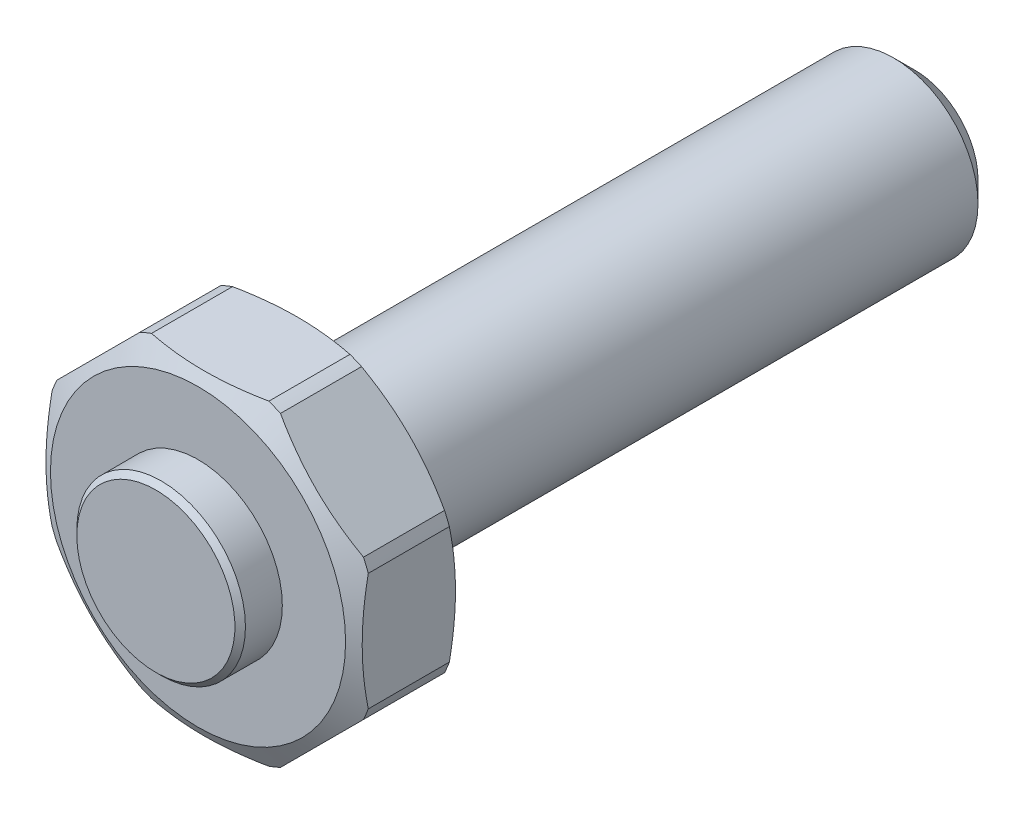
ISO-10303-21;
HEADER;
FILE_DESCRIPTION(('STEP AP214'),'2;1');
FILE_NAME('part.step','',(''),(''),'','','');
FILE_SCHEMA(('AUTOMOTIVE_DESIGN { 1 0 10303 214 1 1 1 1 }'));
ENDSEC;
DATA;
#1=APPLICATION_CONTEXT('core data for automotive mechanical design processes');
#2=APPLICATION_PROTOCOL_DEFINITION('international standard','automotive_design',2000,#1);
#3=PRODUCT_CONTEXT('',#1,'mechanical');
#4=PRODUCT('Part','Part','',(#3));
#5=PRODUCT_RELATED_PRODUCT_CATEGORY('part','',(#4));
#6=PRODUCT_DEFINITION_FORMATION('','',#4);
#7=PRODUCT_DEFINITION_CONTEXT('part definition',#1,'design');
#8=PRODUCT_DEFINITION('design','',#6,#7);
#9=PRODUCT_DEFINITION_SHAPE('','',#8);
#10=(LENGTH_UNIT() NAMED_UNIT(*) SI_UNIT(.MILLI.,.METRE.));
#11=(NAMED_UNIT(*) PLANE_ANGLE_UNIT() SI_UNIT($,.RADIAN.));
#12=(NAMED_UNIT(*) SI_UNIT($,.STERADIAN.) SOLID_ANGLE_UNIT());
#13=UNCERTAINTY_MEASURE_WITH_UNIT(LENGTH_MEASURE(1.E-05),#10,'distance_accuracy_value','');
#14=(GEOMETRIC_REPRESENTATION_CONTEXT(3) GLOBAL_UNCERTAINTY_ASSIGNED_CONTEXT((#13)) GLOBAL_UNIT_ASSIGNED_CONTEXT((#10,
#11,#12)) REPRESENTATION_CONTEXT('',''));
#15=CARTESIAN_POINT('',(0.,0.,0.));
#16=DIRECTION('',(0.,0.,1.));
#17=DIRECTION('',(1.,0.,0.));
#18=AXIS2_PLACEMENT_3D('',#15,#16,#17);
#19=CARTESIAN_POINT('',(8.,0.,0.));
#20=DIRECTION('',(0.,0.,1.));
#21=DIRECTION('',(1.,0.,0.));
#22=AXIS2_PLACEMENT_3D('',#19,#20,#21);
#23=PLANE('',#22);
#24=CARTESIAN_POINT('',(0.,0.,0.));
#25=DIRECTION('',(0.,0.,1.));
#26=DIRECTION('',(1.,0.,0.));
#27=AXIS2_PLACEMENT_3D('',#24,#25,#26);
#28=CIRCLE('',#27,8.);
#29=CARTESIAN_POINT('',(8.,0.,0.));
#30=VERTEX_POINT('',#29);
#31=EDGE_CURVE('E193',#30,#30,#28,.T.);
#32=ORIENTED_EDGE('',*,*,#31,.T.);
#33=EDGE_LOOP('',(#32));
#34=FACE_BOUND('',#33,.T.);
#35=CARTESIAN_POINT('',(0.,0.,0.));
#36=DIRECTION('',(0.,0.,-1.));
#37=DIRECTION('',(-1.,0.,0.));
#38=AXIS2_PLACEMENT_3D('',#35,#36,#37);
#39=CIRCLE('',#38,14.);
#40=CARTESIAN_POINT('',(-14.,0.,0.));
#41=VERTEX_POINT('',#40);
#42=EDGE_CURVE('E376',#41,#41,#39,.T.);
#43=ORIENTED_EDGE('',*,*,#42,.T.);
#44=EDGE_LOOP('',(#43));
#45=FACE_BOUND('',#44,.T.);
#46=ADVANCED_FACE('F14',(#34,#45),#23,.F.);
#47=CARTESIAN_POINT('',(0.,0.,-58.));
#48=DIRECTION('',(0.,0.,1.));
#49=DIRECTION('',(1.,0.,0.));
#50=AXIS2_PLACEMENT_3D('',#47,#48,#49);
#51=PLANE('',#50);
#52=CARTESIAN_POINT('',(0.,0.,-58.));
#53=DIRECTION('',(0.,0.,1.));
#54=DIRECTION('',(1.,0.,0.));
#55=AXIS2_PLACEMENT_3D('',#52,#53,#54);
#56=CIRCLE('',#55,6.);
#57=CARTESIAN_POINT('',(6.,0.,-58.));
#58=VERTEX_POINT('',#57);
#59=EDGE_CURVE('E205',#58,#58,#56,.F.);
#60=ORIENTED_EDGE('',*,*,#59,.T.);
#61=EDGE_LOOP('',(#60));
#62=FACE_BOUND('',#61,.T.);
#63=ADVANCED_FACE('F334',(#62),#51,.F.);
#64=CARTESIAN_POINT('',(0.,0.,22.));
#65=DIRECTION('',(0.,0.,1.));
#66=DIRECTION('',(1.,0.,0.));
#67=AXIS2_PLACEMENT_3D('',#64,#65,#66);
#68=CYLINDRICAL_SURFACE('',#67,8.);
#69=CARTESIAN_POINT('',(0.,0.,-56.));
#70=DIRECTION('',(0.,0.,1.));
#71=DIRECTION('',(1.,0.,0.));
#72=AXIS2_PLACEMENT_3D('',#69,#70,#71);
#73=CIRCLE('',#72,8.);
#74=CARTESIAN_POINT('',(8.,0.,-56.));
#75=VERTEX_POINT('',#74);
#76=EDGE_CURVE('E202',#75,#75,#73,.T.);
#77=ORIENTED_EDGE('',*,*,#76,.T.);
#78=EDGE_LOOP('',(#77));
#79=FACE_BOUND('',#78,.T.);
#80=ORIENTED_EDGE('',*,*,#31,.F.);
#81=EDGE_LOOP('',(#80));
#82=FACE_BOUND('',#81,.T.);
#83=ADVANCED_FACE('F327',(#79,#82),#68,.T.);
#84=CARTESIAN_POINT('',(0.,0.,-56.));
#85=DIRECTION('',(0.,0.,1.));
#86=DIRECTION('',(1.,0.,0.));
#87=AXIS2_PLACEMENT_3D('',#84,#85,#86);
#88=CONICAL_SURFACE('',#87,8.,0.785398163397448);
#89=ORIENTED_EDGE('',*,*,#59,.F.);
#90=EDGE_LOOP('',(#89));
#91=FACE_BOUND('',#90,.T.);
#92=ORIENTED_EDGE('',*,*,#76,.F.);
#93=EDGE_LOOP('',(#92));
#94=FACE_BOUND('',#93,.T.);
#95=ADVANCED_FACE('F16',(#91,#94),#88,.T.);
#96=CARTESIAN_POINT('',(0.,0.,-58.));
#97=DIRECTION('',(0.,0.,-1.));
#98=DIRECTION('',(-1.,0.,0.));
#99=AXIS2_PLACEMENT_3D('',#96,#97,#98);
#100=CYLINDRICAL_SURFACE('',#99,16.);
#101=CARTESIAN_POINT('',(0.,0.,8.84529946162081));
#102=DIRECTION('',(0.,0.,-1.));
#103=DIRECTION('',(-1.,0.,0.));
#104=AXIS2_PLACEMENT_3D('',#101,#102,#103);
#105=CIRCLE('',#104,16.);
#106=CARTESIAN_POINT('',(5.56776436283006,-15.,8.84529946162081));
#107=VERTEX_POINT('',#106);
#108=CARTESIAN_POINT('',(6.66959778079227,-14.5436056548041,8.84529946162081));
#109=VERTEX_POINT('',#108);
#110=EDGE_CURVE('E488',#107,#109,#105,.F.);
#111=ORIENTED_EDGE('',*,*,#110,.F.);
#112=DIRECTION('',(0.,0.,-1.));
#113=VECTOR('',#112,1.);
#114=CARTESIAN_POINT('',(5.56776436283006,-15.,-58.));
#115=LINE('',#114,#113);
#116=CARTESIAN_POINT('',(5.56776436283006,-15.,1.1547005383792));
#117=VERTEX_POINT('',#116);
#118=EDGE_CURVE('E9',#107,#117,#115,.T.);
#119=ORIENTED_EDGE('',*,*,#118,.T.);
#120=CARTESIAN_POINT('',(0.,0.,1.1547005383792));
#121=DIRECTION('',(0.,0.,1.));
#122=DIRECTION('',(1.,0.,0.));
#123=AXIS2_PLACEMENT_3D('',#120,#121,#122);
#124=CIRCLE('',#123,16.);
#125=CARTESIAN_POINT('',(6.66959778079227,-14.5436056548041,1.1547005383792));
#126=VERTEX_POINT('',#125);
#127=EDGE_CURVE('E373',#126,#117,#124,.F.);
#128=ORIENTED_EDGE('',*,*,#127,.F.);
#129=DIRECTION('',(0.,0.,-1.));
#130=VECTOR('',#129,1.);
#131=CARTESIAN_POINT('',(6.66959778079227,-14.5436056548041,-58.));
#132=LINE('',#131,#130);
#133=EDGE_CURVE('E187',#109,#126,#132,.T.);
#134=ORIENTED_EDGE('',*,*,#133,.F.);
#135=EDGE_LOOP('',(#111,#119,#128,#134));
#136=FACE_BOUND('',#135,.T.);
#137=ADVANCED_FACE('F314',(#136),#100,.T.);
#138=CARTESIAN_POINT('',(15.,-5.56776436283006,1.1547005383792));
#139=VERTEX_POINT('',#138);
#140=CARTESIAN_POINT('',(14.5436056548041,-6.66959778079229,1.1547005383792));
#141=VERTEX_POINT('',#140);
#142=EDGE_CURVE('E29',#139,#141,#124,.F.);
#143=ORIENTED_EDGE('',*,*,#142,.F.);
#144=DIRECTION('',(0.,0.,-1.));
#145=VECTOR('',#144,1.);
#146=CARTESIAN_POINT('',(15.,-5.56776436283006,-58.));
#147=LINE('',#146,#145);
#148=CARTESIAN_POINT('',(15.,-5.56776436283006,8.84529946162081));
#149=VERTEX_POINT('',#148);
#150=EDGE_CURVE('E181',#149,#139,#147,.T.);
#151=ORIENTED_EDGE('',*,*,#150,.F.);
#152=CARTESIAN_POINT('',(14.5436056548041,-6.66959778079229,8.84529946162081));
#153=VERTEX_POINT('',#152);
#154=EDGE_CURVE('E482',#153,#149,#105,.F.);
#155=ORIENTED_EDGE('',*,*,#154,.F.);
#156=DIRECTION('',(0.,0.,-1.));
#157=VECTOR('',#156,1.);
#158=CARTESIAN_POINT('',(14.5436056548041,-6.66959778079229,-58.));
#159=LINE('',#158,#157);
#160=EDGE_CURVE('E184',#141,#153,#159,.F.);
#161=ORIENTED_EDGE('',*,*,#160,.F.);
#162=EDGE_LOOP('',(#143,#151,#155,#161));
#163=FACE_BOUND('',#162,.T.);
#164=ADVANCED_FACE('F317',(#163),#100,.T.);
#165=CARTESIAN_POINT('',(14.5436056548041,6.66959778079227,1.1547005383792));
#166=VERTEX_POINT('',#165);
#167=CARTESIAN_POINT('',(15.,5.56776436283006,1.1547005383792));
#168=VERTEX_POINT('',#167);
#169=EDGE_CURVE('E35',#166,#168,#124,.F.);
#170=ORIENTED_EDGE('',*,*,#169,.F.);
#171=DIRECTION('',(0.,0.,-1.));
#172=VECTOR('',#171,1.);
#173=CARTESIAN_POINT('',(14.5436056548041,6.66959778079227,-58.));
#174=LINE('',#173,#172);
#175=CARTESIAN_POINT('',(14.5436056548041,6.66959778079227,8.84529946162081));
#176=VERTEX_POINT('',#175);
#177=EDGE_CURVE('E175',#176,#166,#174,.T.);
#178=ORIENTED_EDGE('',*,*,#177,.F.);
#179=CARTESIAN_POINT('',(15.,5.56776436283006,8.84529946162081));
#180=VERTEX_POINT('',#179);
#181=EDGE_CURVE('E426',#180,#176,#105,.F.);
#182=ORIENTED_EDGE('',*,*,#181,.F.);
#183=DIRECTION('',(0.,0.,-1.));
#184=VECTOR('',#183,1.);
#185=CARTESIAN_POINT('',(15.,5.56776436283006,-58.));
#186=LINE('',#185,#184);
#187=EDGE_CURVE('E178',#168,#180,#186,.F.);
#188=ORIENTED_EDGE('',*,*,#187,.F.);
#189=EDGE_LOOP('',(#170,#178,#182,#188));
#190=FACE_BOUND('',#189,.T.);
#191=ADVANCED_FACE('F325',(#190),#100,.T.);
#192=CARTESIAN_POINT('',(5.56776436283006,15.,1.1547005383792));
#193=VERTEX_POINT('',#192);
#194=CARTESIAN_POINT('',(6.66959778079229,14.5436056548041,1.1547005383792));
#195=VERTEX_POINT('',#194);
#196=EDGE_CURVE('E447',#193,#195,#124,.F.);
#197=ORIENTED_EDGE('',*,*,#196,.F.);
#198=DIRECTION('',(0.,0.,-1.));
#199=VECTOR('',#198,1.);
#200=CARTESIAN_POINT('',(5.56776436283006,15.,-58.));
#201=LINE('',#200,#199);
#202=CARTESIAN_POINT('',(5.56776436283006,15.,8.84529946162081));
#203=VERTEX_POINT('',#202);
#204=EDGE_CURVE('E169',#203,#193,#201,.T.);
#205=ORIENTED_EDGE('',*,*,#204,.F.);
#206=CARTESIAN_POINT('',(6.66959778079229,14.5436056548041,8.84529946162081));
#207=VERTEX_POINT('',#206);
#208=EDGE_CURVE('E424',#207,#203,#105,.F.);
#209=ORIENTED_EDGE('',*,*,#208,.F.);
#210=DIRECTION('',(0.,0.,-1.));
#211=VECTOR('',#210,1.);
#212=CARTESIAN_POINT('',(6.66959778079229,14.5436056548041,-58.));
#213=LINE('',#212,#211);
#214=EDGE_CURVE('E172',#195,#207,#213,.F.);
#215=ORIENTED_EDGE('',*,*,#214,.F.);
#216=EDGE_LOOP('',(#197,#205,#209,#215));
#217=FACE_BOUND('',#216,.T.);
#218=ADVANCED_FACE('F431',(#217),#100,.T.);
#219=CARTESIAN_POINT('',(-6.66959778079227,14.5436056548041,1.1547005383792));
#220=VERTEX_POINT('',#219);
#221=CARTESIAN_POINT('',(-5.56776436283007,15.,1.1547005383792));
#222=VERTEX_POINT('',#221);
#223=EDGE_CURVE('E444',#220,#222,#124,.F.);
#224=ORIENTED_EDGE('',*,*,#223,.F.);
#225=DIRECTION('',(0.,0.,-1.));
#226=VECTOR('',#225,1.);
#227=CARTESIAN_POINT('',(-6.66959778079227,14.5436056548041,-58.));
#228=LINE('',#227,#226);
#229=CARTESIAN_POINT('',(-6.66959778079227,14.5436056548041,8.84529946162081));
#230=VERTEX_POINT('',#229);
#231=EDGE_CURVE('E158',#230,#220,#228,.T.);
#232=ORIENTED_EDGE('',*,*,#231,.F.);
#233=CARTESIAN_POINT('',(-5.56776436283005,15.,8.84529946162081));
#234=VERTEX_POINT('',#233);
#235=EDGE_CURVE('E372',#234,#230,#105,.F.);
#236=ORIENTED_EDGE('',*,*,#235,.F.);
#237=DIRECTION('',(0.,0.,-1.));
#238=VECTOR('',#237,1.);
#239=CARTESIAN_POINT('',(-5.56776436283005,15.,-58.));
#240=LINE('',#239,#238);
#241=EDGE_CURVE('E166',#222,#234,#240,.F.);
#242=ORIENTED_EDGE('',*,*,#241,.F.);
#243=EDGE_LOOP('',(#224,#232,#236,#242));
#244=FACE_BOUND('',#243,.T.);
#245=ADVANCED_FACE('F453',(#244),#100,.T.);
#246=DIRECTION('',(0.,0.,-1.));
#247=VECTOR('',#246,1.);
#248=CARTESIAN_POINT('',(-15.,-5.56776436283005,-58.));
#249=LINE('',#248,#247);
#250=CARTESIAN_POINT('',(-15.,-5.56776436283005,8.84529946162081));
#251=VERTEX_POINT('',#250);
#252=CARTESIAN_POINT('',(-15.,-5.56776436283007,1.1547005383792));
#253=VERTEX_POINT('',#252);
#254=EDGE_CURVE('E145',#251,#253,#249,.T.);
#255=ORIENTED_EDGE('',*,*,#254,.T.);
#256=CARTESIAN_POINT('',(-14.5436056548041,-6.66959778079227,1.1547005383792));
#257=VERTEX_POINT('',#256);
#258=EDGE_CURVE('E440',#257,#253,#124,.F.);
#259=ORIENTED_EDGE('',*,*,#258,.F.);
#260=DIRECTION('',(0.,0.,-1.));
#261=VECTOR('',#260,1.);
#262=CARTESIAN_POINT('',(-14.5436056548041,-6.66959778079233,-58.));
#263=LINE('',#262,#261);
#264=CARTESIAN_POINT('',(-14.5436056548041,-6.66959778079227,8.84529946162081));
#265=VERTEX_POINT('',#264);
#266=EDGE_CURVE('E148',#257,#265,#263,.F.);
#267=ORIENTED_EDGE('',*,*,#266,.T.);
#268=EDGE_CURVE('E131',#251,#265,#105,.F.);
#269=ORIENTED_EDGE('',*,*,#268,.F.);
#270=EDGE_LOOP('',(#255,#259,#267,#269));
#271=FACE_BOUND('',#270,.T.);
#272=ADVANCED_FACE('F143',(#271),#100,.T.);
#273=CARTESIAN_POINT('',(-15.,5.56776436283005,1.1547005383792));
#274=VERTEX_POINT('',#273);
#275=CARTESIAN_POINT('',(-14.5436056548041,6.66959778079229,1.1547005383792));
#276=VERTEX_POINT('',#275);
#277=EDGE_CURVE('E443',#274,#276,#124,.F.);
#278=ORIENTED_EDGE('',*,*,#277,.F.);
#279=DIRECTION('',(0.,0.,-1.));
#280=VECTOR('',#279,1.);
#281=CARTESIAN_POINT('',(-15.,5.56776436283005,-58.));
#282=LINE('',#281,#280);
#283=CARTESIAN_POINT('',(-15.,5.56776436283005,8.84529946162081));
#284=VERTEX_POINT('',#283);
#285=EDGE_CURVE('E155',#274,#284,#282,.F.);
#286=ORIENTED_EDGE('',*,*,#285,.T.);
#287=CARTESIAN_POINT('',(-14.5436056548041,6.66959778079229,8.84529946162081));
#288=VERTEX_POINT('',#287);
#289=EDGE_CURVE('E134',#288,#284,#105,.F.);
#290=ORIENTED_EDGE('',*,*,#289,.F.);
#291=DIRECTION('',(0.,0.,-1.));
#292=VECTOR('',#291,1.);
#293=CARTESIAN_POINT('',(-14.5436056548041,6.66959778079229,-58.));
#294=LINE('',#293,#292);
#295=EDGE_CURVE('E154',#276,#288,#294,.F.);
#296=ORIENTED_EDGE('',*,*,#295,.F.);
#297=EDGE_LOOP('',(#278,#286,#290,#296));
#298=FACE_BOUND('',#297,.T.);
#299=ADVANCED_FACE('F331',(#298),#100,.T.);
#300=DIRECTION('',(0.,0.,-1.));
#301=VECTOR('',#300,1.);
#302=CARTESIAN_POINT('',(-6.66959778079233,-14.5436056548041,-58.));
#303=LINE('',#302,#301);
#304=CARTESIAN_POINT('',(-6.66959778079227,-14.5436056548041,8.84529946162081));
#305=VERTEX_POINT('',#304);
#306=CARTESIAN_POINT('',(-6.66959778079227,-14.5436056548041,1.1547005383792));
#307=VERTEX_POINT('',#306);
#308=EDGE_CURVE('E160',#305,#307,#303,.T.);
#309=ORIENTED_EDGE('',*,*,#308,.T.);
#310=CARTESIAN_POINT('',(-5.56776436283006,-15.,1.1547005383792));
#311=VERTEX_POINT('',#310);
#312=EDGE_CURVE('E442',#311,#307,#124,.F.);
#313=ORIENTED_EDGE('',*,*,#312,.F.);
#314=DIRECTION('',(0.,0.,-1.));
#315=VECTOR('',#314,1.);
#316=CARTESIAN_POINT('',(-5.56776436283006,-15.,-58.));
#317=LINE('',#316,#315);
#318=CARTESIAN_POINT('',(-5.56776436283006,-15.,8.84529946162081));
#319=VERTEX_POINT('',#318);
#320=EDGE_CURVE('E22',#311,#319,#317,.F.);
#321=ORIENTED_EDGE('',*,*,#320,.T.);
#322=EDGE_CURVE('E150',#305,#319,#105,.F.);
#323=ORIENTED_EDGE('',*,*,#322,.F.);
#324=EDGE_LOOP('',(#309,#313,#321,#323));
#325=FACE_BOUND('',#324,.T.);
#326=ADVANCED_FACE('F224',(#325),#100,.T.);
#327=CARTESIAN_POINT('',(0.,0.,1.2741428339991));
#328=DIRECTION('',(0.,0.,1.));
#329=DIRECTION('',(1.,0.,0.));
#330=AXIS2_PLACEMENT_3D('',#327,#328,#329);
#331=CONICAL_SURFACE('',#330,16.2068801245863,1.0471975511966);
#332=CARTESIAN_POINT('',(14.5443095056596,-6.6688939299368,1.1549005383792));
#333=CARTESIAN_POINT('',(14.2907573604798,-6.92244607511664,1.08282477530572));
#334=CARTESIAN_POINT('',(14.0363374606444,-7.17686597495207,1.01666218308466));
#335=CARTESIAN_POINT('',(13.5259358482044,-7.68726758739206,0.897181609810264));
#336=CARTESIAN_POINT('',(13.2699537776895,-7.94324965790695,0.843866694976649));
#337=CARTESIAN_POINT('',(12.7566071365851,-8.45659629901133,0.751114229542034));
#338=CARTESIAN_POINT('',(12.4992419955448,-8.71396144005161,0.711682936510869));
#339=CARTESIAN_POINT('',(11.9836133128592,-9.22959012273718,0.647551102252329));
#340=CARTESIAN_POINT('',(11.7253498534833,-9.48785358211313,0.622849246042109));
#341=CARTESIAN_POINT('',(11.2123611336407,-10.0008423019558,0.588989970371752));
#342=CARTESIAN_POINT('',(10.9576437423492,-10.2555596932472,0.579595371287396));
#343=CARTESIAN_POINT('',(10.4481406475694,-10.765062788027,0.57581890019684));
#344=CARTESIAN_POINT('',(10.1933549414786,-11.0198484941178,0.581437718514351));
#345=CARTESIAN_POINT('',(9.68431863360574,-11.5288848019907,0.607555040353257));
#346=CARTESIAN_POINT('',(9.43006780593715,-11.7831356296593,0.628044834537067));
#347=CARTESIAN_POINT('',(8.9223780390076,-12.2908253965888,0.683445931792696));
#348=CARTESIAN_POINT('',(8.66893902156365,-12.5442644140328,0.718355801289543));
#349=CARTESIAN_POINT('',(8.26991529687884,-12.9432881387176,0.784248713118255));
#350=CARTESIAN_POINT('',(8.12394484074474,-13.0892585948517,0.810673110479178));
#351=CARTESIAN_POINT('',(7.83245226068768,-13.3807511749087,0.867921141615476));
#352=CARTESIAN_POINT('',(7.68693008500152,-13.5262733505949,0.89874424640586));
#353=CARTESIAN_POINT('',(7.39568681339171,-13.8175166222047,0.964759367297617));
#354=CARTESIAN_POINT('',(7.24996796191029,-13.9632354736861,0.999971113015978));
#355=CARTESIAN_POINT('',(6.95903868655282,-14.2541647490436,1.07444745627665));
#356=CARTESIAN_POINT('',(6.8138282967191,-14.3993751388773,1.11371232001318));
#357=CARTESIAN_POINT('',(6.66889392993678,-14.5443095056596,1.1549005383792));
#358=B_SPLINE_CURVE_WITH_KNOTS('',3,(#332,#333,#334,#335,#336,#337,#338,#339,#340,#341,#342,
#343,#344,#345,#346,#347,#348,#349,#350,#351,#352,#353,#354,#355,#356,#357),.UNSPECIFIED.,.F.,
.F.,(4,2,2,2,2,2,2,2,2,2,2,2,4),(0.,1.09725360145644,2.19476881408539,3.2927780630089,
4.39068927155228,5.4714212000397,6.55220282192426,7.6323519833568,8.71239378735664,
9.33670545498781,9.96094210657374,10.5880937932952,11.2152866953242),.UNSPECIFIED.);
#359=EDGE_CURVE('E276',#141,#126,#358,.T.);
#360=ORIENTED_EDGE('',*,*,#359,.T.);
#361=ORIENTED_EDGE('',*,*,#127,.T.);
#362=CARTESIAN_POINT('',(-18.7182965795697,-15.,5.76597857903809));
#363=CARTESIAN_POINT('',(-18.4338852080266,-15.,5.63784396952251));
#364=CARTESIAN_POINT('',(-18.1490489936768,-15.,5.51065308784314));
#365=CARTESIAN_POINT('',(-17.57844667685,-15.,5.25836161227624));
#366=CARTESIAN_POINT('',(-17.2926805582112,-15.,5.13326105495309));
#367=CARTESIAN_POINT('',(-16.4337525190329,-15.,4.7613497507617));
#368=CARTESIAN_POINT('',(-15.8590894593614,-15.,4.51798750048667));
#369=CARTESIAN_POINT('',(-14.7016882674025,-15.,4.04109882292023));
#370=CARTESIAN_POINT('',(-14.11892244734,-15.,3.80763938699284));
#371=CARTESIAN_POINT('',(-12.9479737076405,-15.,3.3547682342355));
#372=CARTESIAN_POINT('',(-12.3597911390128,-15.,3.13535561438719));
#373=CARTESIAN_POINT('',(-11.1833470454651,-15.,2.71609774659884));
#374=CARTESIAN_POINT('',(-10.5951499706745,-15.,2.51607271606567));
#375=CARTESIAN_POINT('',(-9.41191530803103,-15.,2.1370427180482));
#376=CARTESIAN_POINT('',(-8.81687721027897,-15.,1.95803932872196));
#377=CARTESIAN_POINT('',(-7.6208901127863,-15.,1.62626024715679));
#378=CARTESIAN_POINT('',(-7.01995712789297,-15.,1.47342733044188));
#379=CARTESIAN_POINT('',(-5.81102244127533,-15.,1.19897131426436));
#380=CARTESIAN_POINT('',(-5.20302250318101,-15.,1.07734059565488));
#381=CARTESIAN_POINT('',(-4.24104375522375,-15.,0.914758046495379));
#382=CARTESIAN_POINT('',(-3.88912344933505,-15.,0.861504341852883));
#383=CARTESIAN_POINT('',(-3.18356517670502,-15.,0.768033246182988));
#384=CARTESIAN_POINT('',(-2.82992734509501,-15.,0.727814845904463));
#385=CARTESIAN_POINT('',(-2.12129042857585,-15.,0.66119231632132));
#386=CARTESIAN_POINT('',(-1.76629113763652,-15.,0.634790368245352));
#387=CARTESIAN_POINT('',(-1.05550709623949,-15.,0.596361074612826));
#388=CARTESIAN_POINT('',(-0.699722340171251,-15.,0.584333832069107));
#389=CARTESIAN_POINT('',(0.0123500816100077,-15.,0.57491255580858));
#390=CARTESIAN_POINT('',(0.368637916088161,-15.,0.577531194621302));
#391=CARTESIAN_POINT('',(1.08080070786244,-15.,0.597373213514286));
#392=CARTESIAN_POINT('',(1.43667566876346,-15.,0.614596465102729));
#393=CARTESIAN_POINT('',(2.14733127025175,-15.,0.663268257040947));
#394=CARTESIAN_POINT('',(2.5021122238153,-15.,0.69471225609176));
#395=CARTESIAN_POINT('',(3.2102307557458,-15.,0.771183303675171));
#396=CARTESIAN_POINT('',(3.56356819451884,-15.,0.816211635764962));
#397=CARTESIAN_POINT('',(4.28565395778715,-15.,0.921518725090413));
#398=CARTESIAN_POINT('',(4.65430875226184,-15.,0.982436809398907));
#399=CARTESIAN_POINT('',(5.38927148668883,-15.,1.11714646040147));
#400=CARTESIAN_POINT('',(5.75557920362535,-15.,1.19093923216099));
#401=CARTESIAN_POINT('',(6.85091671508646,-15.,1.42985571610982));
#402=CARTESIAN_POINT('',(7.57615630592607,-15.,1.61248648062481));
#403=CARTESIAN_POINT('',(9.01882617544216,-15.,2.01558915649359));
#404=CARTESIAN_POINT('',(9.73621549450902,-15.,2.23620444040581));
#405=CARTESIAN_POINT('',(11.1612204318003,-15.,2.70646047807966));
#406=CARTESIAN_POINT('',(11.8688373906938,-15.,2.95609720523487));
#407=CARTESIAN_POINT('',(13.2842994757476,-15.,3.48104677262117));
#408=CARTESIAN_POINT('',(13.9920407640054,-15.,3.75663719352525));
#409=CARTESIAN_POINT('',(15.4003441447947,-15.,4.32566372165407));
#410=CARTESIAN_POINT('',(16.1009056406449,-15.,4.6191012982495));
#411=CARTESIAN_POINT('',(17.1438365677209,-15.,5.0682492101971));
#412=CARTESIAN_POINT('',(17.4884869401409,-15.,5.21870269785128));
#413=CARTESIAN_POINT('',(18.1764436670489,-15.,5.52265904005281));
#414=CARTESIAN_POINT('',(18.5197500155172,-15.,5.67616190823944));
#415=CARTESIAN_POINT('',(19.2050331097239,-15.,5.98582997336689));
#416=CARTESIAN_POINT('',(19.5470102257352,-15.,6.14199435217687));
#417=CARTESIAN_POINT('',(20.2298395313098,-15.,6.45674675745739));
#418=CARTESIAN_POINT('',(20.5706917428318,-15.,6.61533473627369));
#419=CARTESIAN_POINT('',(20.9110384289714,-15.,6.77499568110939));
#420=B_SPLINE_CURVE_WITH_KNOTS('',3,(#362,#363,#364,#365,#366,#367,#368,#369,#370,#371,#372,
#373,#374,#375,#376,#377,#378,#379,#380,#381,#382,#383,#384,#385,#386,#387,#388,#389,#390,#391,
#392,#393,#394,#395,#396,#397,#398,#399,#400,#401,#402,#403,#404,#405,#406,#407,#408,#409,#410,
#411,#412,#413,#414,#415,#416,#417,#418,#419),.UNSPECIFIED.,.F.,.F.,(4,2,2,2,2,2,2,2,2,2,2,2,2,
2,2,2,2,2,2,2,2,2,2,2,2,2,2,2,4),(0.,0.935825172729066,1.87166669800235,3.74377293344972,
5.6269965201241,7.51009891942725,9.37361534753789,11.2372715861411,13.0967992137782,
14.9558723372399,16.0234445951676,17.0909341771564,18.1585922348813,19.2262579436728,
20.2948476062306,21.3634278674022,22.4316671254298,23.500007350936,24.6207129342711,
25.7415234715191,27.9837640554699,30.2346613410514,32.4852466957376,34.7634603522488,
37.0418618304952,38.1700270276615,39.2981972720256,40.4260267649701,41.5538341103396),.UNSPECIFIED.);
#421=EDGE_CURVE('E208',#311,#117,#420,.T.);
#422=ORIENTED_EDGE('',*,*,#421,.F.);
#423=ORIENTED_EDGE('',*,*,#312,.T.);
#424=CARTESIAN_POINT('',(-14.5443095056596,-6.66889392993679,1.1549005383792));
#425=CARTESIAN_POINT('',(-14.2907573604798,-6.92244607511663,1.08282477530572));
#426=CARTESIAN_POINT('',(-14.0363374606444,-7.17686597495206,1.01666218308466));
#427=CARTESIAN_POINT('',(-13.5259358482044,-7.68726758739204,0.897181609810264));
#428=CARTESIAN_POINT('',(-13.2699537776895,-7.94324965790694,0.843866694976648));
#429=CARTESIAN_POINT('',(-12.7566071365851,-8.45659629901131,0.751114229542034));
#430=CARTESIAN_POINT('',(-12.4992419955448,-8.71396144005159,0.711682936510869));
#431=CARTESIAN_POINT('',(-11.9836133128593,-9.22959012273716,0.647551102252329));
#432=CARTESIAN_POINT('',(-11.7253498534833,-9.48785358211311,0.622849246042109));
#433=CARTESIAN_POINT('',(-11.2123611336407,-10.0008423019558,0.588989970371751));
#434=CARTESIAN_POINT('',(-10.9576437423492,-10.2555596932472,0.579595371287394));
#435=CARTESIAN_POINT('',(-10.4481406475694,-10.765062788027,0.575818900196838));
#436=CARTESIAN_POINT('',(-10.1933549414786,-11.0198484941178,0.58143771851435));
#437=CARTESIAN_POINT('',(-9.68431863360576,-11.5288848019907,0.607555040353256));
#438=CARTESIAN_POINT('',(-9.43006780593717,-11.7831356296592,0.628044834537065));
#439=CARTESIAN_POINT('',(-8.92237803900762,-12.2908253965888,0.683445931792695));
#440=CARTESIAN_POINT('',(-8.66893902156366,-12.5442644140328,0.718355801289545));
#441=CARTESIAN_POINT('',(-8.26991529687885,-12.9432881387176,0.784248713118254));
#442=CARTESIAN_POINT('',(-8.12394484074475,-13.0892585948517,0.810673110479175));
#443=CARTESIAN_POINT('',(-7.83245226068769,-13.3807511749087,0.867921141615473));
#444=CARTESIAN_POINT('',(-7.68693008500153,-13.5262733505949,0.898744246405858));
#445=CARTESIAN_POINT('',(-7.39568681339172,-13.8175166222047,0.964759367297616));
#446=CARTESIAN_POINT('',(-7.24996796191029,-13.9632354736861,0.999971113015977));
#447=CARTESIAN_POINT('',(-6.95903868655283,-14.2541647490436,1.07444745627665));
#448=CARTESIAN_POINT('',(-6.81382829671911,-14.3993751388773,1.11371232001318));
#449=CARTESIAN_POINT('',(-6.66889392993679,-14.5443095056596,1.1549005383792));
#450=B_SPLINE_CURVE_WITH_KNOTS('',3,(#424,#425,#426,#427,#428,#429,#430,#431,#432,#433,#434,
#435,#436,#437,#438,#439,#440,#441,#442,#443,#444,#445,#446,#447,#448,#449),.UNSPECIFIED.,.F.,
.F.,(4,2,2,2,2,2,2,2,2,2,2,2,4),(0.,1.09725360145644,2.19476881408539,3.2927780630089,
4.39068927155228,5.4714212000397,6.55220282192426,7.6323519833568,8.71239378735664,
9.33670545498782,9.96094210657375,10.5880937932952,11.2152866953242),.UNSPECIFIED.);
#451=EDGE_CURVE('E233',#257,#307,#450,.T.);
#452=ORIENTED_EDGE('',*,*,#451,.F.);
#453=ORIENTED_EDGE('',*,*,#258,.T.);
#454=CARTESIAN_POINT('',(-15.,-18.7182965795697,5.76597857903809));
#455=CARTESIAN_POINT('',(-15.,-18.4338852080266,5.63784396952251));
#456=CARTESIAN_POINT('',(-15.,-18.1490489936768,5.51065308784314));
#457=CARTESIAN_POINT('',(-15.,-17.57844667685,5.25836161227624));
#458=CARTESIAN_POINT('',(-15.,-17.2926805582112,5.13326105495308));
#459=CARTESIAN_POINT('',(-15.,-16.4337525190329,4.7613497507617));
#460=CARTESIAN_POINT('',(-15.,-15.8590894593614,4.51798750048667));
#461=CARTESIAN_POINT('',(-15.,-14.7016882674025,4.04109882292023));
#462=CARTESIAN_POINT('',(-15.,-14.11892244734,3.80763938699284));
#463=CARTESIAN_POINT('',(-15.,-12.9479737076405,3.3547682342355));
#464=CARTESIAN_POINT('',(-15.,-12.3597911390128,3.13535561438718));
#465=CARTESIAN_POINT('',(-15.,-11.1833470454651,2.71609774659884));
#466=CARTESIAN_POINT('',(-15.,-10.5951499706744,2.51607271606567));
#467=CARTESIAN_POINT('',(-15.,-9.41191530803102,2.1370427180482));
#468=CARTESIAN_POINT('',(-15.,-8.81687721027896,1.95803932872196));
#469=CARTESIAN_POINT('',(-15.,-7.62089011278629,1.62626024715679));
#470=CARTESIAN_POINT('',(-15.,-7.01995712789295,1.47342733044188));
#471=CARTESIAN_POINT('',(-15.,-5.81102244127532,1.19897131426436));
#472=CARTESIAN_POINT('',(-15.,-5.203022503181,1.07734059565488));
#473=CARTESIAN_POINT('',(-15.,-4.24104375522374,0.914758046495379));
#474=CARTESIAN_POINT('',(-15.,-3.88912344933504,0.861504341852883));
#475=CARTESIAN_POINT('',(-15.,-3.18356517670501,0.768033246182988));
#476=CARTESIAN_POINT('',(-15.,-2.829927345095,0.727814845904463));
#477=CARTESIAN_POINT('',(-15.,-2.12129042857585,0.66119231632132));
#478=CARTESIAN_POINT('',(-15.,-1.76629113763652,0.634790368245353));
#479=CARTESIAN_POINT('',(-15.,-1.05550709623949,0.596361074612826));
#480=CARTESIAN_POINT('',(-15.,-0.699722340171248,0.584333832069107));
#481=CARTESIAN_POINT('',(-15.,0.01235008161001,0.57491255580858));
#482=CARTESIAN_POINT('',(-15.,0.368637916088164,0.577531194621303));
#483=CARTESIAN_POINT('',(-15.,1.08080070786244,0.597373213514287));
#484=CARTESIAN_POINT('',(-15.,1.43667566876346,0.61459646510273));
#485=CARTESIAN_POINT('',(-15.,2.14733127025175,0.663268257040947));
#486=CARTESIAN_POINT('',(-15.,2.5021122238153,0.69471225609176));
#487=CARTESIAN_POINT('',(-15.,3.2102307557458,0.771183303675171));
#488=CARTESIAN_POINT('',(-15.,3.56356819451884,0.816211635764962));
#489=CARTESIAN_POINT('',(-15.,4.28565395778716,0.921518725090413));
#490=CARTESIAN_POINT('',(-15.,4.65430875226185,0.982436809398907));
#491=CARTESIAN_POINT('',(-15.,5.38927148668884,1.11714646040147));
#492=CARTESIAN_POINT('',(-15.,5.75557920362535,1.19093923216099));
#493=CARTESIAN_POINT('',(-15.,6.85091671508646,1.42985571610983));
#494=CARTESIAN_POINT('',(-15.,7.57615630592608,1.61248648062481));
#495=CARTESIAN_POINT('',(-15.,9.01882617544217,2.01558915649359));
#496=CARTESIAN_POINT('',(-15.,9.73621549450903,2.23620444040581));
#497=CARTESIAN_POINT('',(-15.,11.1612204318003,2.70646047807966));
#498=CARTESIAN_POINT('',(-15.,11.8688373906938,2.95609720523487));
#499=CARTESIAN_POINT('',(-15.,13.2842994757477,3.48104677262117));
#500=CARTESIAN_POINT('',(-15.,13.9920407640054,3.75663719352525));
#501=CARTESIAN_POINT('',(-15.,15.4003441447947,4.32566372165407));
#502=CARTESIAN_POINT('',(-15.,16.1009056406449,4.6191012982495));
#503=CARTESIAN_POINT('',(-15.,17.1438365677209,5.0682492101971));
#504=CARTESIAN_POINT('',(-15.,17.4884869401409,5.21870269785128));
#505=CARTESIAN_POINT('',(-15.,18.1764436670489,5.52265904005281));
#506=CARTESIAN_POINT('',(-15.,18.5197500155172,5.67616190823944));
#507=CARTESIAN_POINT('',(-15.,19.2050331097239,5.98582997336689));
#508=CARTESIAN_POINT('',(-15.,19.5470102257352,6.14199435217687));
#509=CARTESIAN_POINT('',(-15.,20.2298395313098,6.45674675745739));
#510=CARTESIAN_POINT('',(-15.,20.5706917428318,6.61533473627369));
#511=CARTESIAN_POINT('',(-15.,20.9110384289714,6.77499568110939));
#512=B_SPLINE_CURVE_WITH_KNOTS('',3,(#454,#455,#456,#457,#458,#459,#460,#461,#462,#463,#464,
#465,#466,#467,#468,#469,#470,#471,#472,#473,#474,#475,#476,#477,#478,#479,#480,#481,#482,#483,
#484,#485,#486,#487,#488,#489,#490,#491,#492,#493,#494,#495,#496,#497,#498,#499,#500,#501,#502,
#503,#504,#505,#506,#507,#508,#509,#510,#511),.UNSPECIFIED.,.F.,.F.,(4,2,2,2,2,2,2,2,2,2,2,2,2,
2,2,2,2,2,2,2,2,2,2,2,2,2,2,2,4),(0.,0.935825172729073,1.87166669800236,3.74377293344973,
5.6269965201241,7.51009891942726,9.37361534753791,11.2372715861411,13.0967992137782,
14.9558723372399,16.0234445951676,17.0909341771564,18.1585922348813,19.2262579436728,
20.2948476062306,21.3634278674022,22.4316671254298,23.500007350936,24.6207129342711,
25.7415234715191,27.98376405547,30.2346613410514,32.4852466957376,34.7634603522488,
37.0418618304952,38.1700270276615,39.2981972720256,40.4260267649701,41.5538341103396),.UNSPECIFIED.);
#513=EDGE_CURVE('E153',#274,#253,#512,.F.);
#514=ORIENTED_EDGE('',*,*,#513,.F.);
#515=ORIENTED_EDGE('',*,*,#277,.T.);
#516=CARTESIAN_POINT('',(-14.5443095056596,6.6688939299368,1.1549005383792));
#517=CARTESIAN_POINT('',(-14.2907573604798,6.92244607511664,1.08282477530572));
#518=CARTESIAN_POINT('',(-14.0363374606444,7.17686597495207,1.01666218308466));
#519=CARTESIAN_POINT('',(-13.5259358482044,7.68726758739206,0.897181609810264));
#520=CARTESIAN_POINT('',(-13.2699537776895,7.94324965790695,0.843866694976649));
#521=CARTESIAN_POINT('',(-12.7566071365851,8.45659629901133,0.751114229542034));
#522=CARTESIAN_POINT('',(-12.4992419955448,8.71396144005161,0.711682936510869));
#523=CARTESIAN_POINT('',(-11.9836133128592,9.22959012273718,0.647551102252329));
#524=CARTESIAN_POINT('',(-11.7253498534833,9.48785358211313,0.622849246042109));
#525=CARTESIAN_POINT('',(-11.2123611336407,10.0008423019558,0.588989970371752));
#526=CARTESIAN_POINT('',(-10.9576437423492,10.2555596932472,0.579595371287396));
#527=CARTESIAN_POINT('',(-10.4481406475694,10.765062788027,0.57581890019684));
#528=CARTESIAN_POINT('',(-10.1933549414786,11.0198484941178,0.581437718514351));
#529=CARTESIAN_POINT('',(-9.68431863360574,11.5288848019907,0.607555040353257));
#530=CARTESIAN_POINT('',(-9.43006780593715,11.7831356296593,0.628044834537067));
#531=CARTESIAN_POINT('',(-8.9223780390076,12.2908253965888,0.683445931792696));
#532=CARTESIAN_POINT('',(-8.66893902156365,12.5442644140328,0.718355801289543));
#533=CARTESIAN_POINT('',(-8.26991529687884,12.9432881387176,0.784248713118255));
#534=CARTESIAN_POINT('',(-8.12394484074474,13.0892585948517,0.810673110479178));
#535=CARTESIAN_POINT('',(-7.83245226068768,13.3807511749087,0.867921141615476));
#536=CARTESIAN_POINT('',(-7.68693008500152,13.5262733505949,0.89874424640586));
#537=CARTESIAN_POINT('',(-7.39568681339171,13.8175166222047,0.964759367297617));
#538=CARTESIAN_POINT('',(-7.24996796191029,13.9632354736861,0.999971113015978));
#539=CARTESIAN_POINT('',(-6.95903868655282,14.2541647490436,1.07444745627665));
#540=CARTESIAN_POINT('',(-6.8138282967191,14.3993751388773,1.11371232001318));
#541=CARTESIAN_POINT('',(-6.66889392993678,14.5443095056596,1.1549005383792));
#542=B_SPLINE_CURVE_WITH_KNOTS('',3,(#516,#517,#518,#519,#520,#521,#522,#523,#524,#525,#526,
#527,#528,#529,#530,#531,#532,#533,#534,#535,#536,#537,#538,#539,#540,#541),.UNSPECIFIED.,.F.,
.F.,(4,2,2,2,2,2,2,2,2,2,2,2,4),(0.,1.09725360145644,2.19476881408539,3.2927780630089,
4.39068927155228,5.4714212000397,6.55220282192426,7.6323519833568,8.71239378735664,
9.33670545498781,9.96094210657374,10.5880937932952,11.2152866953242),.UNSPECIFIED.);
#543=EDGE_CURVE('E248',#276,#220,#542,.T.);
#544=ORIENTED_EDGE('',*,*,#543,.T.);
#545=ORIENTED_EDGE('',*,*,#223,.T.);
#546=CARTESIAN_POINT('',(-18.7182965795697,15.,5.76597857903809));
#547=CARTESIAN_POINT('',(-18.4338852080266,15.,5.63784396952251));
#548=CARTESIAN_POINT('',(-18.1490489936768,15.,5.51065308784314));
#549=CARTESIAN_POINT('',(-17.57844667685,15.,5.25836161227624));
#550=CARTESIAN_POINT('',(-17.2926805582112,15.,5.13326105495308));
#551=CARTESIAN_POINT('',(-16.4337525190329,15.,4.76134975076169));
#552=CARTESIAN_POINT('',(-15.8590894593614,15.,4.51798750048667));
#553=CARTESIAN_POINT('',(-14.7016882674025,15.,4.04109882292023));
#554=CARTESIAN_POINT('',(-14.11892244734,15.,3.80763938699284));
#555=CARTESIAN_POINT('',(-12.9479737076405,15.,3.3547682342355));
#556=CARTESIAN_POINT('',(-12.3597911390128,15.,3.13535561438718));
#557=CARTESIAN_POINT('',(-11.1833470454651,15.,2.71609774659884));
#558=CARTESIAN_POINT('',(-10.5951499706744,15.,2.51607271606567));
#559=CARTESIAN_POINT('',(-9.41191530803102,15.,2.1370427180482));
#560=CARTESIAN_POINT('',(-8.81687721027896,15.,1.95803932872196));
#561=CARTESIAN_POINT('',(-7.62089011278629,15.,1.62626024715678));
#562=CARTESIAN_POINT('',(-7.01995712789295,15.,1.47342733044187));
#563=CARTESIAN_POINT('',(-5.81102244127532,15.,1.19897131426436));
#564=CARTESIAN_POINT('',(-5.203022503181,15.,1.07734059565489));
#565=CARTESIAN_POINT('',(-4.24104375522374,15.,0.914758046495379));
#566=CARTESIAN_POINT('',(-3.88912344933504,15.,0.861504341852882));
#567=CARTESIAN_POINT('',(-3.18356517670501,15.,0.768033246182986));
#568=CARTESIAN_POINT('',(-2.829927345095,15.,0.727814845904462));
#569=CARTESIAN_POINT('',(-2.12129042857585,15.,0.66119231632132));
#570=CARTESIAN_POINT('',(-1.76629113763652,15.,0.634790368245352));
#571=CARTESIAN_POINT('',(-1.05550709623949,15.,0.596361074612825));
#572=CARTESIAN_POINT('',(-0.699722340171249,15.,0.584333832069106));
#573=CARTESIAN_POINT('',(0.0123500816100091,15.,0.57491255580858));
#574=CARTESIAN_POINT('',(0.368637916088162,15.,0.577531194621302));
#575=CARTESIAN_POINT('',(1.08080070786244,15.,0.597373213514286));
#576=CARTESIAN_POINT('',(1.43667566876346,15.,0.614596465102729));
#577=CARTESIAN_POINT('',(2.14733127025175,15.,0.663268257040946));
#578=CARTESIAN_POINT('',(2.5021122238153,15.,0.694712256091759));
#579=CARTESIAN_POINT('',(3.2102307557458,15.,0.771183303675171));
#580=CARTESIAN_POINT('',(3.56356819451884,15.,0.816211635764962));
#581=CARTESIAN_POINT('',(4.28565395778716,15.,0.921518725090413));
#582=CARTESIAN_POINT('',(4.65430875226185,15.,0.982436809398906));
#583=CARTESIAN_POINT('',(5.38927148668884,15.,1.11714646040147));
#584=CARTESIAN_POINT('',(5.75557920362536,15.,1.19093923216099));
#585=CARTESIAN_POINT('',(6.85091671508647,15.,1.42985571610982));
#586=CARTESIAN_POINT('',(7.57615630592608,15.,1.61248648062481));
#587=CARTESIAN_POINT('',(9.01882617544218,15.,2.01558915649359));
#588=CARTESIAN_POINT('',(9.73621549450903,15.,2.23620444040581));
#589=CARTESIAN_POINT('',(11.1612204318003,15.,2.70646047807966));
#590=CARTESIAN_POINT('',(11.8688373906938,15.,2.95609720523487));
#591=CARTESIAN_POINT('',(13.2842994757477,15.,3.48104677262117));
#592=CARTESIAN_POINT('',(13.9920407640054,15.,3.75663719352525));
#593=CARTESIAN_POINT('',(15.4003441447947,15.,4.32566372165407));
#594=CARTESIAN_POINT('',(16.1009056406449,15.,4.6191012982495));
#595=CARTESIAN_POINT('',(17.1438365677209,15.,5.0682492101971));
#596=CARTESIAN_POINT('',(17.4884869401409,15.,5.21870269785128));
#597=CARTESIAN_POINT('',(18.1764436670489,15.,5.52265904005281));
#598=CARTESIAN_POINT('',(18.5197500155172,15.,5.67616190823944));
#599=CARTESIAN_POINT('',(19.2050331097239,15.,5.98582997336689));
#600=CARTESIAN_POINT('',(19.5470102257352,15.,6.14199435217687));
#601=CARTESIAN_POINT('',(20.2298395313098,15.,6.45674675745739));
#602=CARTESIAN_POINT('',(20.5706917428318,15.,6.61533473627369));
#603=CARTESIAN_POINT('',(20.9110384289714,15.,6.77499568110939));
#604=B_SPLINE_CURVE_WITH_KNOTS('',3,(#546,#547,#548,#549,#550,#551,#552,#553,#554,#555,#556,
#557,#558,#559,#560,#561,#562,#563,#564,#565,#566,#567,#568,#569,#570,#571,#572,#573,#574,#575,
#576,#577,#578,#579,#580,#581,#582,#583,#584,#585,#586,#587,#588,#589,#590,#591,#592,#593,#594,
#595,#596,#597,#598,#599,#600,#601,#602,#603),.UNSPECIFIED.,.F.,.F.,(4,2,2,2,2,2,2,2,2,2,2,2,2,
2,2,2,2,2,2,2,2,2,2,2,2,2,2,2,4),(0.,0.935825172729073,1.87166669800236,3.74377293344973,
5.62699652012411,7.51009891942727,9.37361534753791,11.2372715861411,13.0967992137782,
14.9558723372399,16.0234445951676,17.0909341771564,18.1585922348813,19.2262579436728,
20.2948476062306,21.3634278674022,22.4316671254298,23.500007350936,24.6207129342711,
25.7415234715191,27.98376405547,30.2346613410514,32.4852466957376,34.7634603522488,
37.0418618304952,38.1700270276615,39.2981972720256,40.4260267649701,41.5538341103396),.UNSPECIFIED.);
#605=EDGE_CURVE('E256',#222,#193,#604,.T.);
#606=ORIENTED_EDGE('',*,*,#605,.T.);
#607=ORIENTED_EDGE('',*,*,#196,.T.);
#608=CARTESIAN_POINT('',(6.6688939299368,14.5443095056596,1.1549005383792));
#609=CARTESIAN_POINT('',(6.92244607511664,14.2907573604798,1.08282477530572));
#610=CARTESIAN_POINT('',(7.17686597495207,14.0363374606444,1.01666218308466));
#611=CARTESIAN_POINT('',(7.68726758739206,13.5259358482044,0.897181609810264));
#612=CARTESIAN_POINT('',(7.94324965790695,13.2699537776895,0.843866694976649));
#613=CARTESIAN_POINT('',(8.45659629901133,12.7566071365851,0.751114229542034));
#614=CARTESIAN_POINT('',(8.71396144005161,12.4992419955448,0.711682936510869));
#615=CARTESIAN_POINT('',(9.22959012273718,11.9836133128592,0.647551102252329));
#616=CARTESIAN_POINT('',(9.48785358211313,11.7253498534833,0.622849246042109));
#617=CARTESIAN_POINT('',(10.0008423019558,11.2123611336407,0.588989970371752));
#618=CARTESIAN_POINT('',(10.2555596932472,10.9576437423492,0.579595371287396));
#619=CARTESIAN_POINT('',(10.765062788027,10.4481406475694,0.57581890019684));
#620=CARTESIAN_POINT('',(11.0198484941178,10.1933549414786,0.581437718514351));
#621=CARTESIAN_POINT('',(11.5288848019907,9.68431863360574,0.607555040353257));
#622=CARTESIAN_POINT('',(11.7831356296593,9.43006780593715,0.628044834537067));
#623=CARTESIAN_POINT('',(12.2908253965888,8.9223780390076,0.683445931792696));
#624=CARTESIAN_POINT('',(12.5442644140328,8.66893902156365,0.718355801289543));
#625=CARTESIAN_POINT('',(12.9432881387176,8.26991529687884,0.784248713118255));
#626=CARTESIAN_POINT('',(13.0892585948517,8.12394484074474,0.810673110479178));
#627=CARTESIAN_POINT('',(13.3807511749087,7.83245226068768,0.867921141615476));
#628=CARTESIAN_POINT('',(13.5262733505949,7.68693008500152,0.89874424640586));
#629=CARTESIAN_POINT('',(13.8175166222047,7.39568681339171,0.964759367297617));
#630=CARTESIAN_POINT('',(13.9632354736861,7.24996796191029,0.999971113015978));
#631=CARTESIAN_POINT('',(14.2541647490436,6.95903868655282,1.07444745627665));
#632=CARTESIAN_POINT('',(14.3993751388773,6.8138282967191,1.11371232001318));
#633=CARTESIAN_POINT('',(14.5443095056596,6.66889392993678,1.1549005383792));
#634=B_SPLINE_CURVE_WITH_KNOTS('',3,(#608,#609,#610,#611,#612,#613,#614,#615,#616,#617,#618,
#619,#620,#621,#622,#623,#624,#625,#626,#627,#628,#629,#630,#631,#632,#633),.UNSPECIFIED.,.F.,
.F.,(4,2,2,2,2,2,2,2,2,2,2,2,4),(0.,1.09725360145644,2.19476881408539,3.2927780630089,
4.39068927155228,5.4714212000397,6.55220282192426,7.6323519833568,8.71239378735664,
9.33670545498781,9.96094210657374,10.5880937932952,11.2152866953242),.UNSPECIFIED.);
#635=EDGE_CURVE('E263',#195,#166,#634,.T.);
#636=ORIENTED_EDGE('',*,*,#635,.T.);
#637=ORIENTED_EDGE('',*,*,#169,.T.);
#638=CARTESIAN_POINT('',(15.,-18.7182965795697,5.7659785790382));
#639=CARTESIAN_POINT('',(15.,-18.4338852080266,5.63784396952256));
#640=CARTESIAN_POINT('',(15.,-18.1490489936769,5.51065308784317));
#641=CARTESIAN_POINT('',(15.,-17.57844667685,5.25836161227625));
#642=CARTESIAN_POINT('',(15.,-17.2926805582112,5.1332610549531));
#643=CARTESIAN_POINT('',(15.,-16.433752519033,4.76134975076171));
#644=CARTESIAN_POINT('',(15.,-15.8590894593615,4.51798750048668));
#645=CARTESIAN_POINT('',(15.,-14.7016882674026,4.04109882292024));
#646=CARTESIAN_POINT('',(15.,-14.11892244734,3.80763938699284));
#647=CARTESIAN_POINT('',(15.,-12.9479737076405,3.35476823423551));
#648=CARTESIAN_POINT('',(15.,-12.3597911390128,3.13535561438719));
#649=CARTESIAN_POINT('',(15.,-11.1833470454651,2.71609774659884));
#650=CARTESIAN_POINT('',(15.,-10.5951499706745,2.51607271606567));
#651=CARTESIAN_POINT('',(15.,-9.41191530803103,2.1370427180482));
#652=CARTESIAN_POINT('',(15.,-8.81687721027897,1.95803932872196));
#653=CARTESIAN_POINT('',(15.,-7.6208901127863,1.62626024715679));
#654=CARTESIAN_POINT('',(15.,-7.01995712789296,1.47342733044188));
#655=CARTESIAN_POINT('',(15.,-5.81102244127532,1.19897131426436));
#656=CARTESIAN_POINT('',(15.,-5.20302250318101,1.07734059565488));
#657=CARTESIAN_POINT('',(15.,-4.24104375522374,0.914758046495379));
#658=CARTESIAN_POINT('',(15.,-3.88912344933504,0.861504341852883));
#659=CARTESIAN_POINT('',(15.,-3.18356517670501,0.768033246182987));
#660=CARTESIAN_POINT('',(15.,-2.829927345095,0.727814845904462));
#661=CARTESIAN_POINT('',(15.,-2.12129042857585,0.66119231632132));
#662=CARTESIAN_POINT('',(15.,-1.76629113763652,0.634790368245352));
#663=CARTESIAN_POINT('',(15.,-1.05550709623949,0.596361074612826));
#664=CARTESIAN_POINT('',(15.,-0.69972234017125,0.584333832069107));
#665=CARTESIAN_POINT('',(15.,0.0123500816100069,0.57491255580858));
#666=CARTESIAN_POINT('',(15.,0.36863791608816,0.577531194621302));
#667=CARTESIAN_POINT('',(15.,1.08080070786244,0.597373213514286));
#668=CARTESIAN_POINT('',(15.,1.43667566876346,0.614596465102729));
#669=CARTESIAN_POINT('',(15.,2.14733127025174,0.663268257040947));
#670=CARTESIAN_POINT('',(15.,2.50211222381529,0.69471225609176));
#671=CARTESIAN_POINT('',(15.,3.2102307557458,0.771183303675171));
#672=CARTESIAN_POINT('',(15.,3.56356819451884,0.816211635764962));
#673=CARTESIAN_POINT('',(15.,4.28565395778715,0.921518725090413));
#674=CARTESIAN_POINT('',(15.,4.65430875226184,0.982436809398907));
#675=CARTESIAN_POINT('',(15.,5.38927148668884,1.11714646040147));
#676=CARTESIAN_POINT('',(15.,5.75557920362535,1.19093923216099));
#677=CARTESIAN_POINT('',(15.,6.85091671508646,1.42985571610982));
#678=CARTESIAN_POINT('',(15.,7.57615630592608,1.61248648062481));
#679=CARTESIAN_POINT('',(15.,9.01882617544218,2.01558915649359));
#680=CARTESIAN_POINT('',(15.,9.73621549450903,2.23620444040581));
#681=CARTESIAN_POINT('',(15.,11.1612204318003,2.70646047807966));
#682=CARTESIAN_POINT('',(15.,11.8688373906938,2.95609720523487));
#683=CARTESIAN_POINT('',(15.,13.2842994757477,3.48104677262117));
#684=CARTESIAN_POINT('',(15.,13.9920407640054,3.75663719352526));
#685=CARTESIAN_POINT('',(15.,15.4003441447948,4.32566372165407));
#686=CARTESIAN_POINT('',(15.,16.1009056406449,4.6191012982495));
#687=CARTESIAN_POINT('',(15.,17.1438365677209,5.06824921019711));
#688=CARTESIAN_POINT('',(15.,17.4884869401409,5.21870269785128));
#689=CARTESIAN_POINT('',(15.,18.1764436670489,5.52265904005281));
#690=CARTESIAN_POINT('',(15.,18.5197500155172,5.67616190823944));
#691=CARTESIAN_POINT('',(15.,19.2050331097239,5.98582997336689));
#692=CARTESIAN_POINT('',(15.,19.5470102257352,6.14199435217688));
#693=CARTESIAN_POINT('',(15.,20.2298395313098,6.45674675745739));
#694=CARTESIAN_POINT('',(15.,20.5706917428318,6.61533473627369));
#695=CARTESIAN_POINT('',(15.,20.9110384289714,6.77499568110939));
#696=B_SPLINE_CURVE_WITH_KNOTS('',3,(#638,#639,#640,#641,#642,#643,#644,#645,#646,#647,#648,
#649,#650,#651,#652,#653,#654,#655,#656,#657,#658,#659,#660,#661,#662,#663,#664,#665,#666,#667,
#668,#669,#670,#671,#672,#673,#674,#675,#676,#677,#678,#679,#680,#681,#682,#683,#684,#685,#686,
#687,#688,#689,#690,#691,#692,#693,#694,#695),.UNSPECIFIED.,.F.,.F.,(4,2,2,2,2,2,2,2,2,2,2,2,2,
2,2,2,2,2,2,2,2,2,2,2,2,2,2,2,4),(0.,0.935825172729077,1.87166669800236,3.74377293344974,
5.62699652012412,7.51009891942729,9.37361534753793,11.2372715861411,13.0967992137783,
14.95587233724,16.0234445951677,17.0909341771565,18.1585922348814,19.2262579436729,
20.2948476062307,21.3634278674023,22.4316671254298,23.500007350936,24.6207129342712,
25.7415234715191,27.98376405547,30.2346613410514,32.4852466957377,34.7634603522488,
37.0418618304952,38.1700270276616,39.2981972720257,40.4260267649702,41.5538341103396),.UNSPECIFIED.);
#697=EDGE_CURVE('E270',#168,#139,#696,.F.);
#698=ORIENTED_EDGE('',*,*,#697,.T.);
#699=ORIENTED_EDGE('',*,*,#142,.T.);
#700=EDGE_LOOP('',(#360,#361,#422,#423,#452,#453,#514,#515,#544,#545,#606,#607,#636,#637,#698,#699));
#701=FACE_BOUND('',#700,.T.);
#702=ORIENTED_EDGE('',*,*,#42,.F.);
#703=EDGE_LOOP('',(#702));
#704=FACE_BOUND('',#703,.T.);
#705=ADVANCED_FACE('F220',(#701,#704),#331,.T.);
#706=CARTESIAN_POINT('',(0.,0.,10.));
#707=DIRECTION('',(0.,0.,-1.));
#708=DIRECTION('',(-1.,0.,0.));
#709=AXIS2_PLACEMENT_3D('',#706,#707,#708);
#710=CONICAL_SURFACE('',#709,14.,1.0471975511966);
#711=CARTESIAN_POINT('',(6.66889392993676,-14.5443095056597,8.8450994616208));
#712=CARTESIAN_POINT('',(6.9224460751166,-14.2907573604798,8.91717522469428));
#713=CARTESIAN_POINT('',(7.17686597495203,-14.0363374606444,8.98333781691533));
#714=CARTESIAN_POINT('',(7.68726758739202,-13.5259358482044,9.10281839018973));
#715=CARTESIAN_POINT('',(7.94324965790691,-13.2699537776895,9.15613330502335));
#716=CARTESIAN_POINT('',(8.45659629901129,-12.7566071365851,9.24888577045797));
#717=CARTESIAN_POINT('',(8.71396144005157,-12.4992419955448,9.28831706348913));
#718=CARTESIAN_POINT('',(9.22959012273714,-11.9836133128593,9.35244889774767));
#719=CARTESIAN_POINT('',(9.48785358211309,-11.7253498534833,9.37715075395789));
#720=CARTESIAN_POINT('',(10.0008423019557,-11.2123611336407,9.41101002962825));
#721=CARTESIAN_POINT('',(10.2555596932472,-10.9576437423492,9.42040462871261));
#722=CARTESIAN_POINT('',(10.765062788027,-10.4481406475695,9.42418109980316));
#723=CARTESIAN_POINT('',(11.0198484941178,-10.1933549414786,9.41856228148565));
#724=CARTESIAN_POINT('',(11.5288848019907,-9.68431863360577,9.39244495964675));
#725=CARTESIAN_POINT('',(11.7831356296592,-9.43006780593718,9.37195516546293));
#726=CARTESIAN_POINT('',(12.2908253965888,-8.92237803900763,9.31655406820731));
#727=CARTESIAN_POINT('',(12.5442644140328,-8.66893902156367,9.28164419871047));
#728=CARTESIAN_POINT('',(12.9432881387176,-8.26991529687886,9.21575128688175));
#729=CARTESIAN_POINT('',(13.0892585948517,-8.12394484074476,9.18932688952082));
#730=CARTESIAN_POINT('',(13.3807511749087,-7.83245226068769,9.13207885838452));
#731=CARTESIAN_POINT('',(13.5262733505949,-7.68693008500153,9.10125575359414));
#732=CARTESIAN_POINT('',(13.8175166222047,-7.39568681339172,9.03524063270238));
#733=CARTESIAN_POINT('',(13.9632354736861,-7.2499679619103,9.00002888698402));
#734=CARTESIAN_POINT('',(14.2541647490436,-6.95903868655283,8.92555254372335));
#735=CARTESIAN_POINT('',(14.3993751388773,-6.8138282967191,8.88628767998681));
#736=CARTESIAN_POINT('',(14.5443095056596,-6.66889392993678,8.8450994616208));
#737=B_SPLINE_CURVE_WITH_KNOTS('',3,(#711,#712,#713,#714,#715,#716,#717,#718,#719,#720,#721,
#722,#723,#724,#725,#726,#727,#728,#729,#730,#731,#732,#733,#734,#735,#736),.UNSPECIFIED.,.F.,
.F.,(4,2,2,2,2,2,2,2,2,2,2,2,4),(0.,1.09725360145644,2.19476881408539,3.29277806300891,
4.3906892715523,5.47142120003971,6.55220282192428,7.63235198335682,8.71239378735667,
9.33670545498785,9.96094210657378,10.5880937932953,11.2152866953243),.UNSPECIFIED.);
#738=EDGE_CURVE('E300',#109,#153,#737,.T.);
#739=ORIENTED_EDGE('',*,*,#738,.T.);
#740=ORIENTED_EDGE('',*,*,#154,.T.);
#741=CARTESIAN_POINT('',(15.,-18.7182965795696,4.23402142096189));
#742=CARTESIAN_POINT('',(15.,-18.4338852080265,4.36215603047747));
#743=CARTESIAN_POINT('',(15.,-18.1490489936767,4.48934691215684));
#744=CARTESIAN_POINT('',(15.,-17.5784466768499,4.74163838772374));
#745=CARTESIAN_POINT('',(15.,-17.2926805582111,4.8667389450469));
#746=CARTESIAN_POINT('',(15.,-16.4337525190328,5.23865024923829));
#747=CARTESIAN_POINT('',(15.,-15.8590894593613,5.48201249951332));
#748=CARTESIAN_POINT('',(15.,-14.7016882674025,5.95890117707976));
#749=CARTESIAN_POINT('',(15.,-14.1189224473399,6.19236061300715));
#750=CARTESIAN_POINT('',(15.,-12.9479737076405,6.64523176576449));
#751=CARTESIAN_POINT('',(15.,-12.3597911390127,6.86464438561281));
#752=CARTESIAN_POINT('',(15.,-11.1833470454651,7.28390225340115));
#753=CARTESIAN_POINT('',(15.,-10.5951499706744,7.48392728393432));
#754=CARTESIAN_POINT('',(15.,-9.41191530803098,7.8629572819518));
#755=CARTESIAN_POINT('',(15.,-8.81687721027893,8.04196067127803));
#756=CARTESIAN_POINT('',(15.,-7.62089011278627,8.37373975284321));
#757=CARTESIAN_POINT('',(15.,-7.01995712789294,8.52657266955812));
#758=CARTESIAN_POINT('',(15.,-5.81102244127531,8.80102868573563));
#759=CARTESIAN_POINT('',(15.,-5.203022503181,8.92265940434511));
#760=CARTESIAN_POINT('',(15.,-4.24104375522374,9.08524195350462));
#761=CARTESIAN_POINT('',(15.,-3.88912344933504,9.13849565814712));
#762=CARTESIAN_POINT('',(15.,-3.18356517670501,9.23196675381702));
#763=CARTESIAN_POINT('',(15.,-2.829927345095,9.27218515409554));
#764=CARTESIAN_POINT('',(15.,-2.12129042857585,9.33880768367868));
#765=CARTESIAN_POINT('',(15.,-1.76629113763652,9.36520963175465));
#766=CARTESIAN_POINT('',(15.,-1.05550709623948,9.40363892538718));
#767=CARTESIAN_POINT('',(15.,-0.699722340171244,9.4156661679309));
#768=CARTESIAN_POINT('',(15.,0.0123500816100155,9.42508744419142));
#769=CARTESIAN_POINT('',(15.,0.36863791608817,9.4224688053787));
#770=CARTESIAN_POINT('',(15.,1.08080070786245,9.40262678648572));
#771=CARTESIAN_POINT('',(15.,1.43667566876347,9.38540353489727));
#772=CARTESIAN_POINT('',(15.,2.14733127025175,9.33673174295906));
#773=CARTESIAN_POINT('',(15.,2.5021122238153,9.30528774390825));
#774=CARTESIAN_POINT('',(15.,3.21023075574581,9.22881669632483));
#775=CARTESIAN_POINT('',(15.,3.56356819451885,9.18378836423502));
#776=CARTESIAN_POINT('',(15.,4.28565395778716,9.07848127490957));
#777=CARTESIAN_POINT('',(15.,4.65430875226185,9.01756319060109));
#778=CARTESIAN_POINT('',(15.,5.38927148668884,8.88285353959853));
#779=CARTESIAN_POINT('',(15.,5.75557920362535,8.80906076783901));
#780=CARTESIAN_POINT('',(15.,6.85091671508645,8.57014428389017));
#781=CARTESIAN_POINT('',(15.,7.57615630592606,8.38751351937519));
#782=CARTESIAN_POINT('',(15.,9.01882617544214,7.9844108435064));
#783=CARTESIAN_POINT('',(15.,9.73621549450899,7.76379555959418));
#784=CARTESIAN_POINT('',(15.,11.1612204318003,7.29353952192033));
#785=CARTESIAN_POINT('',(15.,11.8688373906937,7.04390279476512));
#786=CARTESIAN_POINT('',(15.,13.2842994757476,6.51895322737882));
#787=CARTESIAN_POINT('',(15.,13.9920407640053,6.24336280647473));
#788=CARTESIAN_POINT('',(15.,15.4003441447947,5.67433627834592));
#789=CARTESIAN_POINT('',(15.,16.1009056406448,5.38089870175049));
#790=CARTESIAN_POINT('',(15.,17.1438365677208,4.93175078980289));
#791=CARTESIAN_POINT('',(15.,17.4884869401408,4.78129730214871));
#792=CARTESIAN_POINT('',(15.,18.1764436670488,4.47734095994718));
#793=CARTESIAN_POINT('',(15.,18.5197500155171,4.32383809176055));
#794=CARTESIAN_POINT('',(15.,19.2050331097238,4.0141700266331));
#795=CARTESIAN_POINT('',(15.,19.5470102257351,3.85800564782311));
#796=CARTESIAN_POINT('',(15.,20.2298395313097,3.5432532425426));
#797=CARTESIAN_POINT('',(15.,20.5706917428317,3.3846652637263));
#798=CARTESIAN_POINT('',(15.,20.9110384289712,3.22500431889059));
#799=B_SPLINE_CURVE_WITH_KNOTS('',3,(#741,#742,#743,#744,#745,#746,#747,#748,#749,#750,#751,
#752,#753,#754,#755,#756,#757,#758,#759,#760,#761,#762,#763,#764,#765,#766,#767,#768,#769,#770,
#771,#772,#773,#774,#775,#776,#777,#778,#779,#780,#781,#782,#783,#784,#785,#786,#787,#788,#789,
#790,#791,#792,#793,#794,#795,#796,#797,#798),.UNSPECIFIED.,.F.,.F.,(4,2,2,2,2,2,2,2,2,2,2,2,2,
2,2,2,2,2,2,2,2,2,2,2,2,2,2,2,4),(0.,0.935825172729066,1.87166669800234,3.74377293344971,
5.62699652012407,7.51009891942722,9.37361534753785,11.237271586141,13.0967992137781,
14.9558723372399,16.0234445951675,17.0909341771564,18.1585922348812,19.2262579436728,
20.2948476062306,21.3634278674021,22.4316671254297,23.5000073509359,24.620712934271,
25.741523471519,27.9837640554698,30.2346613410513,32.4852466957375,34.7634603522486,
37.041861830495,38.1700270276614,39.2981972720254,40.4260267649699,41.5538341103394),.UNSPECIFIED.);
#800=EDGE_CURVE('E294',#149,#180,#799,.T.);
#801=ORIENTED_EDGE('',*,*,#800,.T.);
#802=ORIENTED_EDGE('',*,*,#181,.T.);
#803=CARTESIAN_POINT('',(14.5443095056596,6.66889392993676,8.8450994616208));
#804=CARTESIAN_POINT('',(14.2907573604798,6.92244607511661,8.91717522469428));
#805=CARTESIAN_POINT('',(14.0363374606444,7.17686597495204,8.98333781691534));
#806=CARTESIAN_POINT('',(13.5259358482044,7.68726758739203,9.10281839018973));
#807=CARTESIAN_POINT('',(13.2699537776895,7.94324965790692,9.15613330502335));
#808=CARTESIAN_POINT('',(12.7566071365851,8.4565962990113,9.24888577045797));
#809=CARTESIAN_POINT('',(12.4992419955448,8.71396144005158,9.28831706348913));
#810=CARTESIAN_POINT('',(11.9836133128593,9.22959012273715,9.35244889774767));
#811=CARTESIAN_POINT('',(11.7253498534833,9.4878535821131,9.37715075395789));
#812=CARTESIAN_POINT('',(11.2123611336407,10.0008423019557,9.41101002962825));
#813=CARTESIAN_POINT('',(10.9576437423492,10.2555596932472,9.42040462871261));
#814=CARTESIAN_POINT('',(10.4481406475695,10.765062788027,9.42418109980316));
#815=CARTESIAN_POINT('',(10.1933549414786,11.0198484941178,9.41856228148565));
#816=CARTESIAN_POINT('',(9.68431863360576,11.5288848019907,9.39244495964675));
#817=CARTESIAN_POINT('',(9.43006780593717,11.7831356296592,9.37195516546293));
#818=CARTESIAN_POINT('',(8.92237803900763,12.2908253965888,9.31655406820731));
#819=CARTESIAN_POINT('',(8.66893902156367,12.5442644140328,9.28164419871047));
#820=CARTESIAN_POINT('',(8.26991529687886,12.9432881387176,9.21575128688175));
#821=CARTESIAN_POINT('',(8.12394484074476,13.0892585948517,9.18932688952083));
#822=CARTESIAN_POINT('',(7.83245226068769,13.3807511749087,9.13207885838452));
#823=CARTESIAN_POINT('',(7.68693008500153,13.5262733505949,9.10125575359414));
#824=CARTESIAN_POINT('',(7.39568681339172,13.8175166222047,9.03524063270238));
#825=CARTESIAN_POINT('',(7.2499679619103,13.9632354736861,9.00002888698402));
#826=CARTESIAN_POINT('',(6.95903868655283,14.2541647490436,8.92555254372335));
#827=CARTESIAN_POINT('',(6.8138282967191,14.3993751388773,8.88628767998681));
#828=CARTESIAN_POINT('',(6.66889392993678,14.5443095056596,8.8450994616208));
#829=B_SPLINE_CURVE_WITH_KNOTS('',3,(#803,#804,#805,#806,#807,#808,#809,#810,#811,#812,#813,
#814,#815,#816,#817,#818,#819,#820,#821,#822,#823,#824,#825,#826,#827,#828),.UNSPECIFIED.,.F.,
.F.,(4,2,2,2,2,2,2,2,2,2,2,2,4),(0.,1.09725360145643,2.19476881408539,3.2927780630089,
4.39068927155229,5.4714212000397,6.55220282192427,7.63235198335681,8.71239378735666,
9.33670545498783,9.96094210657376,10.5880937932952,11.2152866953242),.UNSPECIFIED.);
#830=EDGE_CURVE('E301',#176,#207,#829,.T.);
#831=ORIENTED_EDGE('',*,*,#830,.T.);
#832=ORIENTED_EDGE('',*,*,#208,.T.);
#833=CARTESIAN_POINT('',(-18.7182965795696,15.,4.23402142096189));
#834=CARTESIAN_POINT('',(-18.4338852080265,15.,4.36215603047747));
#835=CARTESIAN_POINT('',(-18.1490489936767,15.,4.48934691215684));
#836=CARTESIAN_POINT('',(-17.5784466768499,15.,4.74163838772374));
#837=CARTESIAN_POINT('',(-17.2926805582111,15.,4.8667389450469));
#838=CARTESIAN_POINT('',(-16.4337525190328,15.,5.23865024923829));
#839=CARTESIAN_POINT('',(-15.8590894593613,15.,5.48201249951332));
#840=CARTESIAN_POINT('',(-14.7016882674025,15.,5.95890117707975));
#841=CARTESIAN_POINT('',(-14.1189224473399,15.,6.19236061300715));
#842=CARTESIAN_POINT('',(-12.9479737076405,15.,6.64523176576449));
#843=CARTESIAN_POINT('',(-12.3597911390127,15.,6.86464438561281));
#844=CARTESIAN_POINT('',(-11.1833470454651,15.,7.28390225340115));
#845=CARTESIAN_POINT('',(-10.5951499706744,15.,7.48392728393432));
#846=CARTESIAN_POINT('',(-9.41191530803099,15.,7.8629572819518));
#847=CARTESIAN_POINT('',(-8.81687721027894,15.,8.04196067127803));
#848=CARTESIAN_POINT('',(-7.62089011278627,15.,8.37373975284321));
#849=CARTESIAN_POINT('',(-7.01995712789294,15.,8.52657266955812));
#850=CARTESIAN_POINT('',(-5.81102244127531,15.,8.80102868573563));
#851=CARTESIAN_POINT('',(-5.203022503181,15.,8.92265940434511));
#852=CARTESIAN_POINT('',(-4.24104375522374,15.,9.08524195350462));
#853=CARTESIAN_POINT('',(-3.88912344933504,15.,9.13849565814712));
#854=CARTESIAN_POINT('',(-3.18356517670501,15.,9.23196675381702));
#855=CARTESIAN_POINT('',(-2.829927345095,15.,9.27218515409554));
#856=CARTESIAN_POINT('',(-2.12129042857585,15.,9.33880768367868));
#857=CARTESIAN_POINT('',(-1.76629113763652,15.,9.36520963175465));
#858=CARTESIAN_POINT('',(-1.05550709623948,15.,9.40363892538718));
#859=CARTESIAN_POINT('',(-0.699722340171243,15.,9.4156661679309));
#860=CARTESIAN_POINT('',(0.0123500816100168,15.,9.42508744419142));
#861=CARTESIAN_POINT('',(0.368637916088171,15.,9.4224688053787));
#862=CARTESIAN_POINT('',(1.08080070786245,15.,9.40262678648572));
#863=CARTESIAN_POINT('',(1.43667566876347,15.,9.38540353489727));
#864=CARTESIAN_POINT('',(2.14733127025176,15.,9.33673174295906));
#865=CARTESIAN_POINT('',(2.50211222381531,15.,9.30528774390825));
#866=CARTESIAN_POINT('',(3.21023075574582,15.,9.22881669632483));
#867=CARTESIAN_POINT('',(3.56356819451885,15.,9.18378836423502));
#868=CARTESIAN_POINT('',(4.28565395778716,15.,9.07848127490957));
#869=CARTESIAN_POINT('',(4.65430875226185,15.,9.01756319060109));
#870=CARTESIAN_POINT('',(5.38927148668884,15.,8.88285353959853));
#871=CARTESIAN_POINT('',(5.75557920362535,15.,8.80906076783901));
#872=CARTESIAN_POINT('',(6.85091671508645,15.,8.57014428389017));
#873=CARTESIAN_POINT('',(7.57615630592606,15.,8.38751351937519));
#874=CARTESIAN_POINT('',(9.01882617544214,15.,7.9844108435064));
#875=CARTESIAN_POINT('',(9.73621549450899,15.,7.76379555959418));
#876=CARTESIAN_POINT('',(11.1612204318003,15.,7.29353952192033));
#877=CARTESIAN_POINT('',(11.8688373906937,15.,7.04390279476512));
#878=CARTESIAN_POINT('',(13.2842994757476,15.,6.51895322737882));
#879=CARTESIAN_POINT('',(13.9920407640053,15.,6.24336280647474));
#880=CARTESIAN_POINT('',(15.4003441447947,15.,5.67433627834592));
#881=CARTESIAN_POINT('',(16.1009056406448,15.,5.38089870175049));
#882=CARTESIAN_POINT('',(17.1438365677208,15.,4.93175078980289));
#883=CARTESIAN_POINT('',(17.4884869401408,15.,4.78129730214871));
#884=CARTESIAN_POINT('',(18.1764436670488,15.,4.47734095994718));
#885=CARTESIAN_POINT('',(18.5197500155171,15.,4.32383809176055));
#886=CARTESIAN_POINT('',(19.2050331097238,15.,4.0141700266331));
#887=CARTESIAN_POINT('',(19.5470102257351,15.,3.85800564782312));
#888=CARTESIAN_POINT('',(20.2298395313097,15.,3.5432532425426));
#889=CARTESIAN_POINT('',(20.5706917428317,15.,3.38466526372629));
#890=CARTESIAN_POINT('',(20.9110384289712,15.,3.22500431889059));
#891=B_SPLINE_CURVE_WITH_KNOTS('',3,(#833,#834,#835,#836,#837,#838,#839,#840,#841,#842,#843,
#844,#845,#846,#847,#848,#849,#850,#851,#852,#853,#854,#855,#856,#857,#858,#859,#860,#861,#862,
#863,#864,#865,#866,#867,#868,#869,#870,#871,#872,#873,#874,#875,#876,#877,#878,#879,#880,#881,
#882,#883,#884,#885,#886,#887,#888,#889,#890),.UNSPECIFIED.,.F.,.F.,(4,2,2,2,2,2,2,2,2,2,2,2,2,
2,2,2,2,2,2,2,2,2,2,2,2,2,2,2,4),(0.,0.935825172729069,1.87166669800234,3.74377293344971,
5.62699652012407,7.51009891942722,9.37361534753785,11.237271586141,13.0967992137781,
14.9558723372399,16.0234445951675,17.0909341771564,18.1585922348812,19.2262579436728,
20.2948476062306,21.3634278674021,22.4316671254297,23.5000073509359,24.620712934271,
25.741523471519,27.9837640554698,30.2346613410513,32.4852466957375,34.7634603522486,
37.041861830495,38.1700270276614,39.2981972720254,40.4260267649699,41.5538341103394),.UNSPECIFIED.);
#892=EDGE_CURVE('E412',#203,#234,#891,.F.);
#893=ORIENTED_EDGE('',*,*,#892,.T.);
#894=ORIENTED_EDGE('',*,*,#235,.T.);
#895=CARTESIAN_POINT('',(-6.66889392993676,14.5443095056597,8.8450994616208));
#896=CARTESIAN_POINT('',(-6.9224460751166,14.2907573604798,8.91717522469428));
#897=CARTESIAN_POINT('',(-7.17686597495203,14.0363374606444,8.98333781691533));
#898=CARTESIAN_POINT('',(-7.68726758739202,13.5259358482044,9.10281839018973));
#899=CARTESIAN_POINT('',(-7.94324965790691,13.2699537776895,9.15613330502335));
#900=CARTESIAN_POINT('',(-8.45659629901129,12.7566071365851,9.24888577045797));
#901=CARTESIAN_POINT('',(-8.71396144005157,12.4992419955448,9.28831706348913));
#902=CARTESIAN_POINT('',(-9.22959012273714,11.9836133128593,9.35244889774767));
#903=CARTESIAN_POINT('',(-9.48785358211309,11.7253498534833,9.37715075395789));
#904=CARTESIAN_POINT('',(-10.0008423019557,11.2123611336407,9.41101002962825));
#905=CARTESIAN_POINT('',(-10.2555596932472,10.9576437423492,9.42040462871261));
#906=CARTESIAN_POINT('',(-10.765062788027,10.4481406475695,9.42418109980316));
#907=CARTESIAN_POINT('',(-11.0198484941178,10.1933549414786,9.41856228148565));
#908=CARTESIAN_POINT('',(-11.5288848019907,9.68431863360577,9.39244495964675));
#909=CARTESIAN_POINT('',(-11.7831356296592,9.43006780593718,9.37195516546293));
#910=CARTESIAN_POINT('',(-12.2908253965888,8.92237803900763,9.31655406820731));
#911=CARTESIAN_POINT('',(-12.5442644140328,8.66893902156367,9.28164419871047));
#912=CARTESIAN_POINT('',(-12.9432881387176,8.26991529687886,9.21575128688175));
#913=CARTESIAN_POINT('',(-13.0892585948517,8.12394484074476,9.18932688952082));
#914=CARTESIAN_POINT('',(-13.3807511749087,7.83245226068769,9.13207885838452));
#915=CARTESIAN_POINT('',(-13.5262733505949,7.68693008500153,9.10125575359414));
#916=CARTESIAN_POINT('',(-13.8175166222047,7.39568681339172,9.03524063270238));
#917=CARTESIAN_POINT('',(-13.9632354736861,7.2499679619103,9.00002888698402));
#918=CARTESIAN_POINT('',(-14.2541647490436,6.95903868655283,8.92555254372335));
#919=CARTESIAN_POINT('',(-14.3993751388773,6.8138282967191,8.88628767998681));
#920=CARTESIAN_POINT('',(-14.5443095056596,6.66889392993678,8.8450994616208));
#921=B_SPLINE_CURVE_WITH_KNOTS('',3,(#895,#896,#897,#898,#899,#900,#901,#902,#903,#904,#905,
#906,#907,#908,#909,#910,#911,#912,#913,#914,#915,#916,#917,#918,#919,#920),.UNSPECIFIED.,.F.,
.F.,(4,2,2,2,2,2,2,2,2,2,2,2,4),(0.,1.09725360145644,2.19476881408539,3.29277806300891,
4.3906892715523,5.47142120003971,6.55220282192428,7.63235198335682,8.71239378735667,
9.33670545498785,9.96094210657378,10.5880937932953,11.2152866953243),.UNSPECIFIED.);
#922=EDGE_CURVE('E138',#230,#288,#921,.T.);
#923=ORIENTED_EDGE('',*,*,#922,.T.);
#924=ORIENTED_EDGE('',*,*,#289,.T.);
#925=CARTESIAN_POINT('',(-15.,-18.7182965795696,4.23402142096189));
#926=CARTESIAN_POINT('',(-15.,-18.4338852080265,4.36215603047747));
#927=CARTESIAN_POINT('',(-15.,-18.1490489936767,4.48934691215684));
#928=CARTESIAN_POINT('',(-15.,-17.5784466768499,4.74163838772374));
#929=CARTESIAN_POINT('',(-15.,-17.2926805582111,4.8667389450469));
#930=CARTESIAN_POINT('',(-15.,-16.4337525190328,5.23865024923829));
#931=CARTESIAN_POINT('',(-15.,-15.8590894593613,5.48201249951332));
#932=CARTESIAN_POINT('',(-15.,-14.7016882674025,5.95890117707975));
#933=CARTESIAN_POINT('',(-15.,-14.1189224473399,6.19236061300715));
#934=CARTESIAN_POINT('',(-15.,-12.9479737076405,6.64523176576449));
#935=CARTESIAN_POINT('',(-15.,-12.3597911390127,6.86464438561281));
#936=CARTESIAN_POINT('',(-15.,-11.1833470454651,7.28390225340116));
#937=CARTESIAN_POINT('',(-15.,-10.5951499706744,7.48392728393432));
#938=CARTESIAN_POINT('',(-15.,-9.41191530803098,7.8629572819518));
#939=CARTESIAN_POINT('',(-15.,-8.81687721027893,8.04196067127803));
#940=CARTESIAN_POINT('',(-15.,-7.62089011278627,8.37373975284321));
#941=CARTESIAN_POINT('',(-15.,-7.01995712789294,8.52657266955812));
#942=CARTESIAN_POINT('',(-15.,-5.81102244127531,8.80102868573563));
#943=CARTESIAN_POINT('',(-15.,-5.20302250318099,8.92265940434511));
#944=CARTESIAN_POINT('',(-15.,-4.24104375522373,9.08524195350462));
#945=CARTESIAN_POINT('',(-15.,-3.88912344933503,9.13849565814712));
#946=CARTESIAN_POINT('',(-15.,-3.183565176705,9.23196675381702));
#947=CARTESIAN_POINT('',(-15.,-2.82992734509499,9.27218515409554));
#948=CARTESIAN_POINT('',(-15.,-2.12129042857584,9.33880768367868));
#949=CARTESIAN_POINT('',(-15.,-1.76629113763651,9.36520963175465));
#950=CARTESIAN_POINT('',(-15.,-1.05550709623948,9.40363892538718));
#951=CARTESIAN_POINT('',(-15.,-0.699722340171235,9.4156661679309));
#952=CARTESIAN_POINT('',(-15.,0.0123500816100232,9.42508744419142));
#953=CARTESIAN_POINT('',(-15.,0.368637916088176,9.4224688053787));
#954=CARTESIAN_POINT('',(-15.,1.08080070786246,9.40262678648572));
#955=CARTESIAN_POINT('',(-15.,1.43667566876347,9.38540353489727));
#956=CARTESIAN_POINT('',(-15.,2.14733127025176,9.33673174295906));
#957=CARTESIAN_POINT('',(-15.,2.50211222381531,9.30528774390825));
#958=CARTESIAN_POINT('',(-15.,3.21023075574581,9.22881669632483));
#959=CARTESIAN_POINT('',(-15.,3.56356819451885,9.18378836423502));
#960=CARTESIAN_POINT('',(-15.,4.28565395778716,9.07848127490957));
#961=CARTESIAN_POINT('',(-15.,4.65430875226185,9.01756319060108));
#962=CARTESIAN_POINT('',(-15.,5.38927148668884,8.88285353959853));
#963=CARTESIAN_POINT('',(-15.,5.75557920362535,8.809060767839));
#964=CARTESIAN_POINT('',(-15.,6.85091671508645,8.57014428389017));
#965=CARTESIAN_POINT('',(-15.,7.57615630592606,8.38751351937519));
#966=CARTESIAN_POINT('',(-15.,9.01882617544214,7.9844108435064));
#967=CARTESIAN_POINT('',(-15.,9.73621549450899,7.76379555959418));
#968=CARTESIAN_POINT('',(-15.,11.1612204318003,7.29353952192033));
#969=CARTESIAN_POINT('',(-15.,11.8688373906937,7.04390279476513));
#970=CARTESIAN_POINT('',(-15.,13.2842994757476,6.51895322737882));
#971=CARTESIAN_POINT('',(-15.,13.9920407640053,6.24336280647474));
#972=CARTESIAN_POINT('',(-15.,15.4003441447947,5.67433627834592));
#973=CARTESIAN_POINT('',(-15.,16.1009056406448,5.38089870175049));
#974=CARTESIAN_POINT('',(-15.,17.1438365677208,4.93175078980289));
#975=CARTESIAN_POINT('',(-15.,17.4884869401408,4.78129730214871));
#976=CARTESIAN_POINT('',(-15.,18.1764436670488,4.47734095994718));
#977=CARTESIAN_POINT('',(-15.,18.5197500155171,4.32383809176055));
#978=CARTESIAN_POINT('',(-15.,19.2050331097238,4.0141700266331));
#979=CARTESIAN_POINT('',(-15.,19.5470102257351,3.85800564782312));
#980=CARTESIAN_POINT('',(-15.,20.2298395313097,3.5432532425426));
#981=CARTESIAN_POINT('',(-15.,20.5706917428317,3.3846652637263));
#982=CARTESIAN_POINT('',(-15.,20.9110384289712,3.22500431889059));
#983=B_SPLINE_CURVE_WITH_KNOTS('',3,(#925,#926,#927,#928,#929,#930,#931,#932,#933,#934,#935,
#936,#937,#938,#939,#940,#941,#942,#943,#944,#945,#946,#947,#948,#949,#950,#951,#952,#953,#954,
#955,#956,#957,#958,#959,#960,#961,#962,#963,#964,#965,#966,#967,#968,#969,#970,#971,#972,#973,
#974,#975,#976,#977,#978,#979,#980,#981,#982),.UNSPECIFIED.,.F.,.F.,(4,2,2,2,2,2,2,2,2,2,2,2,2,
2,2,2,2,2,2,2,2,2,2,2,2,2,2,2,4),(0.,0.935825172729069,1.87166669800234,3.74377293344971,
5.62699652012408,7.51009891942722,9.37361534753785,11.237271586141,13.0967992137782,
14.9558723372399,16.0234445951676,17.0909341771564,18.1585922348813,19.2262579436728,
20.2948476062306,21.3634278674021,22.4316671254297,23.5000073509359,24.620712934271,
25.741523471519,27.9837640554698,30.2346613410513,32.4852466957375,34.7634603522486,
37.041861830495,38.1700270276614,39.2981972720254,40.4260267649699,41.5538341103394),.UNSPECIFIED.);
#984=EDGE_CURVE('E127',#251,#284,#983,.T.);
#985=ORIENTED_EDGE('',*,*,#984,.F.);
#986=ORIENTED_EDGE('',*,*,#268,.T.);
#987=CARTESIAN_POINT('',(-6.66889392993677,-14.5443095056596,8.8450994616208));
#988=CARTESIAN_POINT('',(-6.92244607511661,-14.2907573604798,8.91717522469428));
#989=CARTESIAN_POINT('',(-7.17686597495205,-14.0363374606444,8.98333781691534));
#990=CARTESIAN_POINT('',(-7.68726758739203,-13.5259358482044,9.10281839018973));
#991=CARTESIAN_POINT('',(-7.94324965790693,-13.2699537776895,9.15613330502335));
#992=CARTESIAN_POINT('',(-8.45659629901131,-12.7566071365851,9.24888577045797));
#993=CARTESIAN_POINT('',(-8.71396144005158,-12.4992419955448,9.28831706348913));
#994=CARTESIAN_POINT('',(-9.22959012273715,-11.9836133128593,9.35244889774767));
#995=CARTESIAN_POINT('',(-9.4878535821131,-11.7253498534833,9.3771507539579));
#996=CARTESIAN_POINT('',(-10.0008423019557,-11.2123611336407,9.41101002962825));
#997=CARTESIAN_POINT('',(-10.2555596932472,-10.9576437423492,9.42040462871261));
#998=CARTESIAN_POINT('',(-10.765062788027,-10.4481406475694,9.42418109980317));
#999=CARTESIAN_POINT('',(-11.0198484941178,-10.1933549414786,9.41856228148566));
#1000=CARTESIAN_POINT('',(-11.5288848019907,-9.68431863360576,9.39244495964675));
#1001=CARTESIAN_POINT('',(-11.7831356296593,-9.43006780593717,9.37195516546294));
#1002=CARTESIAN_POINT('',(-12.2908253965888,-8.92237803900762,9.31655406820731));
#1003=CARTESIAN_POINT('',(-12.5442644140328,-8.66893902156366,9.28164419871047));
#1004=CARTESIAN_POINT('',(-12.9432881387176,-8.26991529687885,9.21575128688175));
#1005=CARTESIAN_POINT('',(-13.0892585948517,-8.12394484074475,9.18932688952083));
#1006=CARTESIAN_POINT('',(-13.3807511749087,-7.83245226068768,9.13207885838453));
#1007=CARTESIAN_POINT('',(-13.5262733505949,-7.68693008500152,9.10125575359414));
#1008=CARTESIAN_POINT('',(-13.8175166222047,-7.39568681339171,9.03524063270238));
#1009=CARTESIAN_POINT('',(-13.9632354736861,-7.24996796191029,9.00002888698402));
#1010=CARTESIAN_POINT('',(-14.2541647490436,-6.95903868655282,8.92555254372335));
#1011=CARTESIAN_POINT('',(-14.3993751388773,-6.81382829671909,8.88628767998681));
#1012=CARTESIAN_POINT('',(-14.5443095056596,-6.66889392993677,8.8450994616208));
#1013=B_SPLINE_CURVE_WITH_KNOTS('',3,(#987,#988,#989,#990,#991,#992,#993,#994,#995,#996,#997,
#998,#999,#1000,#1001,#1002,#1003,#1004,#1005,#1006,#1007,#1008,#1009,#1010,#1011,#1012),
.UNSPECIFIED.,.F.,.F.,(4,2,2,2,2,2,2,2,2,2,2,2,4),(0.,1.09725360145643,2.19476881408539,
3.2927780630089,4.39068927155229,5.47142120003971,6.55220282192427,7.63235198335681,
8.71239378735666,9.33670545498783,9.96094210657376,10.5880937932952,11.2152866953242),.UNSPECIFIED.);
#1014=EDGE_CURVE('E139',#305,#265,#1013,.T.);
#1015=ORIENTED_EDGE('',*,*,#1014,.F.);
#1016=ORIENTED_EDGE('',*,*,#322,.T.);
#1017=CARTESIAN_POINT('',(-18.7182965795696,-15.,4.23402142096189));
#1018=CARTESIAN_POINT('',(-18.4338852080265,-15.,4.36215603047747));
#1019=CARTESIAN_POINT('',(-18.1490489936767,-15.,4.48934691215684));
#1020=CARTESIAN_POINT('',(-17.5784466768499,-15.,4.74163838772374));
#1021=CARTESIAN_POINT('',(-17.2926805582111,-15.,4.8667389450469));
#1022=CARTESIAN_POINT('',(-16.4337525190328,-15.,5.23865024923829));
#1023=CARTESIAN_POINT('',(-15.8590894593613,-15.,5.48201249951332));
#1024=CARTESIAN_POINT('',(-14.7016882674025,-15.,5.95890117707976));
#1025=CARTESIAN_POINT('',(-14.1189224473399,-15.,6.19236061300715));
#1026=CARTESIAN_POINT('',(-12.9479737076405,-15.,6.64523176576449));
#1027=CARTESIAN_POINT('',(-12.3597911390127,-15.,6.86464438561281));
#1028=CARTESIAN_POINT('',(-11.1833470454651,-15.,7.28390225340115));
#1029=CARTESIAN_POINT('',(-10.5951499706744,-15.,7.48392728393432));
#1030=CARTESIAN_POINT('',(-9.41191530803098,-15.,7.8629572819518));
#1031=CARTESIAN_POINT('',(-8.81687721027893,-15.,8.04196067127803));
#1032=CARTESIAN_POINT('',(-7.62089011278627,-15.,8.37373975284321));
#1033=CARTESIAN_POINT('',(-7.01995712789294,-15.,8.52657266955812));
#1034=CARTESIAN_POINT('',(-5.81102244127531,-15.,8.80102868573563));
#1035=CARTESIAN_POINT('',(-5.203022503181,-15.,8.92265940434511));
#1036=CARTESIAN_POINT('',(-4.24104375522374,-15.,9.08524195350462));
#1037=CARTESIAN_POINT('',(-3.88912344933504,-15.,9.13849565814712));
#1038=CARTESIAN_POINT('',(-3.18356517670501,-15.,9.23196675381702));
#1039=CARTESIAN_POINT('',(-2.829927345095,-15.,9.27218515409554));
#1040=CARTESIAN_POINT('',(-2.12129042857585,-15.,9.33880768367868));
#1041=CARTESIAN_POINT('',(-1.76629113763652,-15.,9.36520963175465));
#1042=CARTESIAN_POINT('',(-1.05550709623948,-15.,9.40363892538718));
#1043=CARTESIAN_POINT('',(-0.699722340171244,-15.,9.4156661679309));
#1044=CARTESIAN_POINT('',(0.0123500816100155,-15.,9.42508744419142));
#1045=CARTESIAN_POINT('',(0.36863791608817,-15.,9.4224688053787));
#1046=CARTESIAN_POINT('',(1.08080070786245,-15.,9.40262678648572));
#1047=CARTESIAN_POINT('',(1.43667566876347,-15.,9.38540353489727));
#1048=CARTESIAN_POINT('',(2.14733127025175,-15.,9.33673174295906));
#1049=CARTESIAN_POINT('',(2.5021122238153,-15.,9.30528774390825));
#1050=CARTESIAN_POINT('',(3.21023075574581,-15.,9.22881669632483));
#1051=CARTESIAN_POINT('',(3.56356819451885,-15.,9.18378836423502));
#1052=CARTESIAN_POINT('',(4.28565395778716,-15.,9.07848127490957));
#1053=CARTESIAN_POINT('',(4.65430875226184,-15.,9.01756319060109));
#1054=CARTESIAN_POINT('',(5.38927148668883,-15.,8.88285353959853));
#1055=CARTESIAN_POINT('',(5.75557920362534,-15.,8.80906076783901));
#1056=CARTESIAN_POINT('',(6.85091671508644,-15.,8.57014428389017));
#1057=CARTESIAN_POINT('',(7.57615630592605,-15.,8.38751351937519));
#1058=CARTESIAN_POINT('',(9.01882617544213,-15.,7.98441084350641));
#1059=CARTESIAN_POINT('',(9.73621549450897,-15.,7.76379555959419));
#1060=CARTESIAN_POINT('',(11.1612204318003,-15.,7.29353952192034));
#1061=CARTESIAN_POINT('',(11.8688373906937,-15.,7.04390279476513));
#1062=CARTESIAN_POINT('',(13.2842994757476,-15.,6.51895322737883));
#1063=CARTESIAN_POINT('',(13.9920407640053,-15.,6.24336280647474));
#1064=CARTESIAN_POINT('',(15.4003441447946,-15.,5.67433627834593));
#1065=CARTESIAN_POINT('',(16.1009056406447,-15.,5.3808987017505));
#1066=CARTESIAN_POINT('',(17.1438365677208,-15.,4.9317507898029));
#1067=CARTESIAN_POINT('',(17.4884869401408,-15.,4.78129730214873));
#1068=CARTESIAN_POINT('',(18.1764436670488,-15.,4.4773409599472));
#1069=CARTESIAN_POINT('',(18.519750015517,-15.,4.32383809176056));
#1070=CARTESIAN_POINT('',(19.2050331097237,-15.,4.01417002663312));
#1071=CARTESIAN_POINT('',(19.5470102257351,-15.,3.85800564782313));
#1072=CARTESIAN_POINT('',(20.2298395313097,-15.,3.54325324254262));
#1073=CARTESIAN_POINT('',(20.5706917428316,-15.,3.38466526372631));
#1074=CARTESIAN_POINT('',(20.9110384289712,-15.,3.22500431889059));
#1075=B_SPLINE_CURVE_WITH_KNOTS('',3,(#1017,#1018,#1019,#1020,#1021,#1022,#1023,#1024,#1025,
#1026,#1027,#1028,#1029,#1030,#1031,#1032,#1033,#1034,#1035,#1036,#1037,#1038,#1039,#1040,#1041,
#1042,#1043,#1044,#1045,#1046,#1047,#1048,#1049,#1050,#1051,#1052,#1053,#1054,#1055,#1056,#1057,
#1058,#1059,#1060,#1061,#1062,#1063,#1064,#1065,#1066,#1067,#1068,#1069,#1070,#1071,#1072,#1073,
#1074),.UNSPECIFIED.,.F.,.F.,(4,2,2,2,2,2,2,2,2,2,2,2,2,2,2,2,2,2,2,2,2,2,2,2,2,2,2,2,4),(0.,
0.935825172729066,1.87166669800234,3.74377293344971,5.62699652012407,7.51009891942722,
9.37361534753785,11.237271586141,13.0967992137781,14.9558723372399,16.0234445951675,
17.0909341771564,18.1585922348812,19.2262579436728,20.2948476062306,21.3634278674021,
22.4316671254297,23.5000073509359,24.620712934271,25.741523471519,27.9837640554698,
30.2346613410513,32.4852466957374,34.7634603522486,37.041861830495,38.1700270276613,
39.2981972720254,40.4260267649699,41.5538341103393),.UNSPECIFIED.);
#1076=EDGE_CURVE('E149',#107,#319,#1075,.F.);
#1077=ORIENTED_EDGE('',*,*,#1076,.F.);
#1078=ORIENTED_EDGE('',*,*,#110,.T.);
#1079=EDGE_LOOP('',(#739,#740,#801,#802,#831,#832,#893,#894,#923,#924,#985,#986,#1015,#1016,
#1077,#1078));
#1080=FACE_BOUND('',#1079,.T.);
#1081=CARTESIAN_POINT('',(0.,0.,10.));
#1082=DIRECTION('',(0.,0.,-1.));
#1083=DIRECTION('',(-1.,0.,0.));
#1084=AXIS2_PLACEMENT_3D('',#1081,#1082,#1083);
#1085=CIRCLE('',#1084,14.);
#1086=CARTESIAN_POINT('',(-14.,0.,10.));
#1087=VERTEX_POINT('',#1086);
#1088=EDGE_CURVE('E370',#1087,#1087,#1085,.T.);
#1089=ORIENTED_EDGE('',*,*,#1088,.T.);
#1090=EDGE_LOOP('',(#1089));
#1091=FACE_BOUND('',#1090,.T.);
#1092=ADVANCED_FACE('F129',(#1080,#1091),#710,.T.);
#1093=CARTESIAN_POINT('',(-6.21320343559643,-15.,10.));
#1094=DIRECTION('',(0.,1.,0.));
#1095=DIRECTION('',(0.,0.,1.));
#1096=AXIS2_PLACEMENT_3D('',#1093,#1094,#1095);
#1097=PLANE('',#1096);
#1098=ORIENTED_EDGE('',*,*,#118,.F.);
#1099=ORIENTED_EDGE('',*,*,#1076,.T.);
#1100=ORIENTED_EDGE('',*,*,#320,.F.);
#1101=ORIENTED_EDGE('',*,*,#421,.T.);
#1102=EDGE_LOOP('',(#1098,#1099,#1100,#1101));
#1103=FACE_BOUND('',#1102,.T.);
#1104=ADVANCED_FACE('F216',(#1103),#1097,.F.);
#1105=CARTESIAN_POINT('',(-15.,-6.21320343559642,10.));
#1106=DIRECTION('',(0.707106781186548,0.707106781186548,0.));
#1107=DIRECTION('',(-0.707106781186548,0.707106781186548,0.));
#1108=AXIS2_PLACEMENT_3D('',#1105,#1106,#1107);
#1109=PLANE('',#1108);
#1110=ORIENTED_EDGE('',*,*,#308,.F.);
#1111=ORIENTED_EDGE('',*,*,#1014,.T.);
#1112=ORIENTED_EDGE('',*,*,#266,.F.);
#1113=ORIENTED_EDGE('',*,*,#451,.T.);
#1114=EDGE_LOOP('',(#1110,#1111,#1112,#1113));
#1115=FACE_BOUND('',#1114,.T.);
#1116=ADVANCED_FACE('F393',(#1115),#1109,.F.);
#1117=CARTESIAN_POINT('',(-15.,6.21320343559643,10.));
#1118=DIRECTION('',(1.,0.,0.));
#1119=DIRECTION('',(0.,1.,0.));
#1120=AXIS2_PLACEMENT_3D('',#1117,#1118,#1119);
#1121=PLANE('',#1120);
#1122=ORIENTED_EDGE('',*,*,#254,.F.);
#1123=ORIENTED_EDGE('',*,*,#984,.T.);
#1124=ORIENTED_EDGE('',*,*,#285,.F.);
#1125=ORIENTED_EDGE('',*,*,#513,.T.);
#1126=EDGE_LOOP('',(#1122,#1123,#1124,#1125));
#1127=FACE_BOUND('',#1126,.T.);
#1128=ADVANCED_FACE('F152',(#1127),#1121,.F.);
#1129=CARTESIAN_POINT('',(-15.,6.21320343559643,10.));
#1130=DIRECTION('',(-0.707106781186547,0.707106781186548,0.));
#1131=DIRECTION('',(-0.707106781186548,-0.707106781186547,0.));
#1132=AXIS2_PLACEMENT_3D('',#1129,#1130,#1131);
#1133=PLANE('',#1132);
#1134=ORIENTED_EDGE('',*,*,#922,.F.);
#1135=ORIENTED_EDGE('',*,*,#231,.T.);
#1136=ORIENTED_EDGE('',*,*,#543,.F.);
#1137=ORIENTED_EDGE('',*,*,#295,.T.);
#1138=EDGE_LOOP('',(#1134,#1135,#1136,#1137));
#1139=FACE_BOUND('',#1138,.T.);
#1140=ADVANCED_FACE('F400',(#1139),#1133,.T.);
#1141=CARTESIAN_POINT('',(-6.21320343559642,15.,10.));
#1142=DIRECTION('',(0.,1.,0.));
#1143=DIRECTION('',(-1.,0.,0.));
#1144=AXIS2_PLACEMENT_3D('',#1141,#1142,#1143);
#1145=PLANE('',#1144);
#1146=ORIENTED_EDGE('',*,*,#892,.F.);
#1147=ORIENTED_EDGE('',*,*,#204,.T.);
#1148=ORIENTED_EDGE('',*,*,#605,.F.);
#1149=ORIENTED_EDGE('',*,*,#241,.T.);
#1150=EDGE_LOOP('',(#1146,#1147,#1148,#1149));
#1151=FACE_BOUND('',#1150,.T.);
#1152=ADVANCED_FACE('F404',(#1151),#1145,.T.);
#1153=CARTESIAN_POINT('',(6.21320343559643,15.,10.));
#1154=DIRECTION('',(0.707106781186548,0.707106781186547,0.));
#1155=DIRECTION('',(-0.707106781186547,0.707106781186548,0.));
#1156=AXIS2_PLACEMENT_3D('',#1153,#1154,#1155);
#1157=PLANE('',#1156);
#1158=ORIENTED_EDGE('',*,*,#830,.F.);
#1159=ORIENTED_EDGE('',*,*,#177,.T.);
#1160=ORIENTED_EDGE('',*,*,#635,.F.);
#1161=ORIENTED_EDGE('',*,*,#214,.T.);
#1162=EDGE_LOOP('',(#1158,#1159,#1160,#1161));
#1163=FACE_BOUND('',#1162,.T.);
#1164=ADVANCED_FACE('F287',(#1163),#1157,.T.);
#1165=CARTESIAN_POINT('',(15.,6.21320343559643,10.));
#1166=DIRECTION('',(1.,0.,0.));
#1167=DIRECTION('',(0.,0.,-1.));
#1168=AXIS2_PLACEMENT_3D('',#1165,#1166,#1167);
#1169=PLANE('',#1168);
#1170=ORIENTED_EDGE('',*,*,#800,.F.);
#1171=ORIENTED_EDGE('',*,*,#150,.T.);
#1172=ORIENTED_EDGE('',*,*,#697,.F.);
#1173=ORIENTED_EDGE('',*,*,#187,.T.);
#1174=EDGE_LOOP('',(#1170,#1171,#1172,#1173));
#1175=FACE_BOUND('',#1174,.T.);
#1176=ADVANCED_FACE('F282',(#1175),#1169,.T.);
#1177=CARTESIAN_POINT('',(15.,-6.21320343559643,10.));
#1178=DIRECTION('',(0.707106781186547,-0.707106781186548,0.));
#1179=DIRECTION('',(0.707106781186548,0.707106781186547,0.));
#1180=AXIS2_PLACEMENT_3D('',#1177,#1178,#1179);
#1181=PLANE('',#1180);
#1182=ORIENTED_EDGE('',*,*,#738,.F.);
#1183=ORIENTED_EDGE('',*,*,#133,.T.);
#1184=ORIENTED_EDGE('',*,*,#359,.F.);
#1185=ORIENTED_EDGE('',*,*,#160,.T.);
#1186=EDGE_LOOP('',(#1182,#1183,#1184,#1185));
#1187=FACE_BOUND('',#1186,.T.);
#1188=ADVANCED_FACE('F286',(#1187),#1181,.T.);
#1189=CARTESIAN_POINT('',(8.,0.,14.));
#1190=DIRECTION('',(0.,0.,-1.));
#1191=DIRECTION('',(-1.,0.,0.));
#1192=AXIS2_PLACEMENT_3D('',#1189,#1190,#1191);
#1193=PLANE('',#1192);
#1194=CARTESIAN_POINT('',(0.,0.,14.));
#1195=DIRECTION('',(0.,0.,-1.));
#1196=DIRECTION('',(-1.,0.,0.));
#1197=AXIS2_PLACEMENT_3D('',#1194,#1195,#1196);
#1198=CIRCLE('',#1197,7.5);
#1199=CARTESIAN_POINT('',(-7.5,0.,14.));
#1200=VERTEX_POINT('',#1199);
#1201=EDGE_CURVE('E196',#1200,#1200,#1198,.F.);
#1202=ORIENTED_EDGE('',*,*,#1201,.T.);
#1203=EDGE_LOOP('',(#1202));
#1204=FACE_BOUND('',#1203,.T.);
#1205=ADVANCED_FACE('F290',(#1204),#1193,.F.);
#1206=CARTESIAN_POINT('',(0.,0.,14.));
#1207=DIRECTION('',(0.,0.,-1.));
#1208=DIRECTION('',(-1.,0.,0.));
#1209=AXIS2_PLACEMENT_3D('',#1206,#1207,#1208);
#1210=CONICAL_SURFACE('',#1209,7.5,0.785398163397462);
#1211=CARTESIAN_POINT('',(0.,0.,13.5));
#1212=DIRECTION('',(0.,0.,-1.));
#1213=DIRECTION('',(-1.,0.,0.));
#1214=AXIS2_PLACEMENT_3D('',#1211,#1212,#1213);
#1215=CIRCLE('',#1214,8.);
#1216=CARTESIAN_POINT('',(-8.,0.,13.5));
#1217=VERTEX_POINT('',#1216);
#1218=EDGE_CURVE('E199',#1217,#1217,#1215,.T.);
#1219=ORIENTED_EDGE('',*,*,#1218,.F.);
#1220=EDGE_LOOP('',(#1219));
#1221=FACE_BOUND('',#1220,.T.);
#1222=ORIENTED_EDGE('',*,*,#1201,.F.);
#1223=EDGE_LOOP('',(#1222));
#1224=FACE_BOUND('',#1223,.T.);
#1225=ADVANCED_FACE('F349',(#1221,#1224),#1210,.T.);
#1226=CARTESIAN_POINT('',(0.,0.,22.));
#1227=DIRECTION('',(0.,0.,1.));
#1228=DIRECTION('',(1.,0.,0.));
#1229=AXIS2_PLACEMENT_3D('',#1226,#1227,#1228);
#1230=CYLINDRICAL_SURFACE('',#1229,8.);
#1231=ORIENTED_EDGE('',*,*,#1218,.T.);
#1232=EDGE_LOOP('',(#1231));
#1233=FACE_BOUND('',#1232,.T.);
#1234=CARTESIAN_POINT('',(0.,0.,10.));
#1235=DIRECTION('',(0.,0.,1.));
#1236=DIRECTION('',(1.,0.,0.));
#1237=AXIS2_PLACEMENT_3D('',#1234,#1235,#1236);
#1238=CIRCLE('',#1237,8.);
#1239=CARTESIAN_POINT('',(8.,0.,10.));
#1240=VERTEX_POINT('',#1239);
#1241=EDGE_CURVE('E190',#1240,#1240,#1238,.T.);
#1242=ORIENTED_EDGE('',*,*,#1241,.T.);
#1243=EDGE_LOOP('',(#1242));
#1244=FACE_BOUND('',#1243,.T.);
#1245=ADVANCED_FACE('F351',(#1233,#1244),#1230,.T.);
#1246=CARTESIAN_POINT('',(17.,0.,10.));
#1247=DIRECTION('',(0.,0.,-1.));
#1248=DIRECTION('',(-1.,0.,0.));
#1249=AXIS2_PLACEMENT_3D('',#1246,#1247,#1248);
#1250=PLANE('',#1249);
#1251=ORIENTED_EDGE('',*,*,#1241,.F.);
#1252=EDGE_LOOP('',(#1251));
#1253=FACE_BOUND('',#1252,.T.);
#1254=ORIENTED_EDGE('',*,*,#1088,.F.);
#1255=EDGE_LOOP('',(#1254));
#1256=FACE_BOUND('',#1255,.T.);
#1257=ADVANCED_FACE('F346',(#1253,#1256),#1250,.F.);
#1258=CLOSED_SHELL('',(#46,#63,#83,#95,#137,#164,#191,#218,#245,#272,#299,#326,#705,#1092,#1104,
#1116,#1128,#1140,#1152,#1164,#1176,#1188,#1205,#1225,#1245,#1257));
#1259=MANIFOLD_SOLID_BREP('B1',#1258);
#1260=ADVANCED_BREP_SHAPE_REPRESENTATION('',(#18,#1259),#14);
#1261=SHAPE_DEFINITION_REPRESENTATION(#9,#1260);
ENDSEC;
END-ISO-10303-21;
